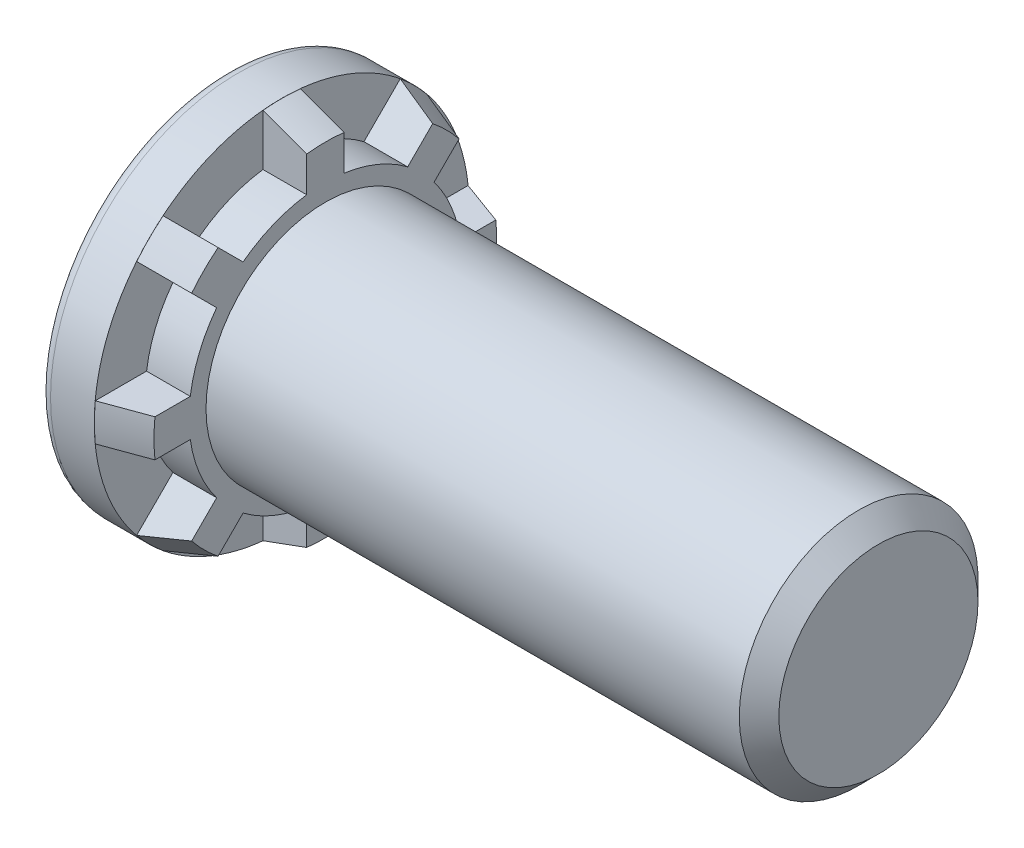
ISO-10303-21;
HEADER;
FILE_DESCRIPTION(('STEP AP214'),'2;1');
FILE_NAME('part.step','',(''),(''),'','','');
FILE_SCHEMA(('AUTOMOTIVE_DESIGN { 1 0 10303 214 1 1 1 1 }'));
ENDSEC;
DATA;
#1=APPLICATION_CONTEXT('core data for automotive mechanical design processes');
#2=APPLICATION_PROTOCOL_DEFINITION('international standard','automotive_design',2000,#1);
#3=PRODUCT_CONTEXT('',#1,'mechanical');
#4=PRODUCT('Part','Part','',(#3));
#5=PRODUCT_RELATED_PRODUCT_CATEGORY('part','',(#4));
#6=PRODUCT_DEFINITION_FORMATION('','',#4);
#7=PRODUCT_DEFINITION_CONTEXT('part definition',#1,'design');
#8=PRODUCT_DEFINITION('design','',#6,#7);
#9=PRODUCT_DEFINITION_SHAPE('','',#8);
#10=(LENGTH_UNIT() NAMED_UNIT(*) SI_UNIT(.MILLI.,.METRE.));
#11=(NAMED_UNIT(*) PLANE_ANGLE_UNIT() SI_UNIT($,.RADIAN.));
#12=(NAMED_UNIT(*) SI_UNIT($,.STERADIAN.) SOLID_ANGLE_UNIT());
#13=UNCERTAINTY_MEASURE_WITH_UNIT(LENGTH_MEASURE(1.E-05),#10,'distance_accuracy_value','');
#14=(GEOMETRIC_REPRESENTATION_CONTEXT(3) GLOBAL_UNCERTAINTY_ASSIGNED_CONTEXT((#13)) GLOBAL_UNIT_ASSIGNED_CONTEXT((#10,
#11,#12)) REPRESENTATION_CONTEXT('',''));
#15=CARTESIAN_POINT('',(0.,0.,0.));
#16=DIRECTION('',(0.,0.,1.));
#17=DIRECTION('',(1.,0.,0.));
#18=AXIS2_PLACEMENT_3D('',#15,#16,#17);
#19=CARTESIAN_POINT('',(0.00254,0.,0.));
#20=DIRECTION('',(-1.,0.,0.));
#21=DIRECTION('',(0.,0.,1.));
#22=AXIS2_PLACEMENT_3D('',#19,#20,#21);
#23=CONICAL_SURFACE('',#22,7.84746,0.349065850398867);
#24=CARTESIAN_POINT('',(5.22484515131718,0.782172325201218,-5.89503216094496));
#25=CARTESIAN_POINT('',(4.4025998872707,0.782172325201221,-6.19690738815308));
#26=CARTESIAN_POINT('',(3.58023889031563,0.782172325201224,-6.49846704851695));
#27=CARTESIAN_POINT('',(1.93534501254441,0.782172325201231,-7.10111683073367));
#28=CARTESIAN_POINT('',(1.11281213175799,0.782172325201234,-7.40220695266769));
#29=CARTESIAN_POINT('',(-0.532366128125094,0.782172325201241,-8.00407932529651));
#30=CARTESIAN_POINT('',(-1.35501150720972,0.782172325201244,-8.30486157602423));
#31=CARTESIAN_POINT('',(-3.00038658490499,0.78217232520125,-8.90619580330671));
#32=CARTESIAN_POINT('',(-3.82311628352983,0.782172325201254,-9.20674777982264));
#33=CARTESIAN_POINT('',(-4.64587386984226,0.782172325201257,-9.50722335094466));
#34=B_SPLINE_CURVE_WITH_KNOTS('',3,(#24,#25,#26,#27,#28,#29,#30,#31,#32,#33),.UNSPECIFIED.,.F.,
.F.,(4,2,2,2,4),(0.,2.62772566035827,5.25545086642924,7.88317579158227,10.510901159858),.UNSPECIFIED.);
#35=CARTESIAN_POINT('',(1.83199999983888,0.782172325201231,-7.1388693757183));
#36=VERTEX_POINT('',#35);
#37=CARTESIAN_POINT('',(0.00254,0.782172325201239,-7.80838234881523));
#38=VERTEX_POINT('',#37);
#39=EDGE_CURVE('E327',#36,#38,#34,.T.);
#40=ORIENTED_EDGE('',*,*,#39,.F.);
#41=CARTESIAN_POINT('',(1.832,0.,0.));
#42=DIRECTION('',(-1.,0.,0.));
#43=DIRECTION('',(0.,0.,1.));
#44=AXIS2_PLACEMENT_3D('',#41,#42,#43);
#45=CIRCLE('',#44,7.18159101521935);
#46=CARTESIAN_POINT('',(1.83199999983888,-0.782172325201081,-7.13886937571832));
#47=VERTEX_POINT('',#46);
#48=EDGE_CURVE('E562',#36,#47,#45,.T.);
#49=ORIENTED_EDGE('',*,*,#48,.T.);
#50=CARTESIAN_POINT('',(-4.64587386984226,-0.782172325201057,-9.50722335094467));
#51=CARTESIAN_POINT('',(-3.82311628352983,-0.78217232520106,-9.20674777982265));
#52=CARTESIAN_POINT('',(-3.00038658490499,-0.782172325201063,-8.90619580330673));
#53=CARTESIAN_POINT('',(-1.35501150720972,-0.782172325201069,-8.30486157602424));
#54=CARTESIAN_POINT('',(-0.532366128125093,-0.782172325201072,-8.00407932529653));
#55=CARTESIAN_POINT('',(1.11281213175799,-0.782172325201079,-7.4022069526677));
#56=CARTESIAN_POINT('',(1.93534501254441,-0.782172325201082,-7.10111683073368));
#57=CARTESIAN_POINT('',(3.58023889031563,-0.782172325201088,-6.49846704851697));
#58=CARTESIAN_POINT('',(4.4025998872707,-0.782172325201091,-6.1969073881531));
#59=CARTESIAN_POINT('',(5.22484515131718,-0.782172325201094,-5.89503216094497));
#60=B_SPLINE_CURVE_WITH_KNOTS('',3,(#50,#51,#52,#53,#54,#55,#56,#57,#58,#59),.UNSPECIFIED.,.F.,
.F.,(4,2,2,2,4),(0.,2.62772536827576,5.25545029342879,7.88317549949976,10.510901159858),.UNSPECIFIED.);
#61=CARTESIAN_POINT('',(0.00254,-0.782172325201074,-7.80838234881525));
#62=VERTEX_POINT('',#61);
#63=EDGE_CURVE('E353',#62,#47,#60,.T.);
#64=ORIENTED_EDGE('',*,*,#63,.F.);
#65=CARTESIAN_POINT('',(0.00254,0.,0.));
#66=DIRECTION('',(-1.,0.,0.));
#67=DIRECTION('',(0.,0.,1.));
#68=AXIS2_PLACEMENT_3D('',#65,#66,#67);
#69=CIRCLE('',#68,7.84746);
#70=EDGE_CURVE('E536',#38,#62,#69,.T.);
#71=ORIENTED_EDGE('',*,*,#70,.F.);
#72=EDGE_LOOP('',(#40,#49,#64,#71));
#73=FACE_BOUND('',#72,.T.);
#74=ADVANCED_FACE('F33',(#73),#23,.T.);
#75=CARTESIAN_POINT('',(0.,0.,0.));
#76=DIRECTION('',(-1.,0.,0.));
#77=DIRECTION('',(0.,0.,1.));
#78=AXIS2_PLACEMENT_3D('',#75,#76,#77);
#79=CYLINDRICAL_SURFACE('',#78,7.84746);
#80=CARTESIAN_POINT('',(0.,0.,0.));
#81=DIRECTION('',(-1.,0.,0.));
#82=DIRECTION('',(0.,0.,1.));
#83=AXIS2_PLACEMENT_3D('',#80,#81,#82);
#84=CIRCLE('',#83,7.84746);
#85=CARTESIAN_POINT('',(0.,0.782172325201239,-7.80838234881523));
#86=VERTEX_POINT('',#85);
#87=CARTESIAN_POINT('',(-1.61121766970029E-10,-0.782172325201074,-7.80838234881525));
#88=VERTEX_POINT('',#87);
#89=EDGE_CURVE('E539',#86,#88,#84,.T.);
#90=ORIENTED_EDGE('',*,*,#89,.F.);
#91=DIRECTION('',(-1.,0.,0.));
#92=VECTOR('',#91,1.);
#93=CARTESIAN_POINT('',(0.,0.782172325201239,-7.80838234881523));
#94=LINE('',#93,#92);
#95=EDGE_CURVE('E11',#86,#38,#94,.F.);
#96=ORIENTED_EDGE('',*,*,#95,.T.);
#97=ORIENTED_EDGE('',*,*,#70,.T.);
#98=DIRECTION('',(-1.,0.,0.));
#99=VECTOR('',#98,1.);
#100=CARTESIAN_POINT('',(0.,-0.782172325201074,-7.80838234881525));
#101=LINE('',#100,#99);
#102=EDGE_CURVE('E598',#62,#88,#101,.T.);
#103=ORIENTED_EDGE('',*,*,#102,.T.);
#104=EDGE_LOOP('',(#90,#96,#97,#103));
#105=FACE_BOUND('',#104,.T.);
#106=ADVANCED_FACE('F709',(#105),#79,.T.);
#107=CARTESIAN_POINT('',(1.83219999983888,-4.49481180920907,-5.60097051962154));
#108=CARTESIAN_POINT('',(1.52724085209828,-4.57376577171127,-5.67992448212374));
#109=CARTESIAN_POINT('',(1.22227294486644,-4.65270280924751,-5.75886151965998));
#110=CARTESIAN_POINT('',(0.612319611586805,-4.81054303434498,-5.91670174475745));
#111=CARTESIAN_POINT('',(0.307334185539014,-4.88944622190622,-5.9956049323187));
#112=CARTESIAN_POINT('',(0.00233999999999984,-4.96833248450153,-6.074491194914));
#113=B_SPLINE_CURVE_WITH_KNOTS('',3,(#107,#108,#109,#110,#111,#112),.UNSPECIFIED.,.F.,.F.,(4,2,
4),(0.,0.974272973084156,1.94854594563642),.UNSPECIFIED.);
#114=CARTESIAN_POINT('',(1.83199999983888,-4.49486359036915,-5.60102230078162));
#115=VERTEX_POINT('',#114);
#116=CARTESIAN_POINT('',(0.00254,-4.96828075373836,-6.07443946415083));
#117=VERTEX_POINT('',#116);
#118=EDGE_CURVE('E346',#115,#117,#113,.T.);
#119=ORIENTED_EDGE('',*,*,#118,.F.);
#120=CARTESIAN_POINT('',(1.83199999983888,-5.60102230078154,-4.49486359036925));
#121=VERTEX_POINT('',#120);
#122=EDGE_CURVE('E712',#115,#121,#45,.T.);
#123=ORIENTED_EDGE('',*,*,#122,.T.);
#124=CARTESIAN_POINT('',(0.00234000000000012,-6.07449119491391,-4.96833248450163));
#125=CARTESIAN_POINT('',(0.307334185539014,-5.99560493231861,-4.88944622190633));
#126=CARTESIAN_POINT('',(0.612319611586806,-5.91670174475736,-4.81054303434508));
#127=CARTESIAN_POINT('',(1.22227294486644,-5.7588615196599,-4.65270280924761));
#128=CARTESIAN_POINT('',(1.52724085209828,-5.67992448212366,-4.57376577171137));
#129=CARTESIAN_POINT('',(1.83219999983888,-5.60097051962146,-4.49481180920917));
#130=B_SPLINE_CURVE_WITH_KNOTS('',3,(#124,#125,#126,#127,#128,#129),.UNSPECIFIED.,.F.,.F.,(4,2,
4),(0.,0.974272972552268,1.94854594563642),.UNSPECIFIED.);
#131=CARTESIAN_POINT('',(0.00254,-6.07443946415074,-4.96828075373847));
#132=VERTEX_POINT('',#131);
#133=EDGE_CURVE('E374',#132,#121,#130,.T.);
#134=ORIENTED_EDGE('',*,*,#133,.F.);
#135=EDGE_CURVE('E704',#117,#132,#69,.T.);
#136=ORIENTED_EDGE('',*,*,#135,.F.);
#137=EDGE_LOOP('',(#119,#123,#134,#136));
#138=FACE_BOUND('',#137,.T.);
#139=ADVANCED_FACE('F762',(#138),#23,.T.);
#140=CARTESIAN_POINT('',(0.,-4.96828075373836,-6.07443946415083));
#141=VERTEX_POINT('',#140);
#142=CARTESIAN_POINT('',(-1.61121766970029E-10,-6.07443946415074,-4.96828075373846));
#143=VERTEX_POINT('',#142);
#144=EDGE_CURVE('E654',#141,#143,#84,.T.);
#145=ORIENTED_EDGE('',*,*,#144,.F.);
#146=DIRECTION('',(-1.,0.,0.));
#147=VECTOR('',#146,1.);
#148=CARTESIAN_POINT('',(0.,-4.96828075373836,-6.07443946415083));
#149=LINE('',#148,#147);
#150=EDGE_CURVE('E601',#141,#117,#149,.F.);
#151=ORIENTED_EDGE('',*,*,#150,.T.);
#152=ORIENTED_EDGE('',*,*,#135,.T.);
#153=DIRECTION('',(-1.,0.,0.));
#154=VECTOR('',#153,1.);
#155=CARTESIAN_POINT('',(0.,-6.07443946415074,-4.96828075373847));
#156=LINE('',#155,#154);
#157=EDGE_CURVE('E592',#132,#143,#156,.T.);
#158=ORIENTED_EDGE('',*,*,#157,.T.);
#159=EDGE_LOOP('',(#145,#151,#152,#158));
#160=FACE_BOUND('',#159,.T.);
#161=ADVANCED_FACE('F655',(#160),#79,.T.);
#162=CARTESIAN_POINT('',(5.22484515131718,-5.89503216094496,-0.782172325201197));
#163=CARTESIAN_POINT('',(4.4025998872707,-6.19690738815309,-0.782172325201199));
#164=CARTESIAN_POINT('',(3.58023889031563,-6.49846704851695,-0.782172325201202));
#165=CARTESIAN_POINT('',(1.93534501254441,-7.10111683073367,-0.782172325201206));
#166=CARTESIAN_POINT('',(1.11281213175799,-7.40220695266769,-0.782172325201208));
#167=CARTESIAN_POINT('',(-0.532366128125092,-8.00407932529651,-0.782172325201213));
#168=CARTESIAN_POINT('',(-1.35501150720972,-8.30486157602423,-0.782172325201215));
#169=CARTESIAN_POINT('',(-3.00038658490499,-8.90619580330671,-0.78217232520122));
#170=CARTESIAN_POINT('',(-3.82311628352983,-9.20674777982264,-0.782172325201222));
#171=CARTESIAN_POINT('',(-4.64587386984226,-9.50722335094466,-0.782172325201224));
#172=B_SPLINE_CURVE_WITH_KNOTS('',3,(#162,#163,#164,#165,#166,#167,#168,#169,#170,#171),
.UNSPECIFIED.,.F.,.F.,(4,2,2,2,4),(0.,2.62772566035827,5.25545086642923,7.88317579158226,
10.510901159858),.UNSPECIFIED.);
#173=CARTESIAN_POINT('',(1.83199999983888,-7.1388693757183,-0.782172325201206));
#174=VERTEX_POINT('',#173);
#175=CARTESIAN_POINT('',(0.00254,-7.80838234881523,-0.782172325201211));
#176=VERTEX_POINT('',#175);
#177=EDGE_CURVE('E383',#174,#176,#172,.T.);
#178=ORIENTED_EDGE('',*,*,#177,.F.);
#179=CARTESIAN_POINT('',(1.83199999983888,-7.13886937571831,0.782172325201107));
#180=VERTEX_POINT('',#179);
#181=EDGE_CURVE('E716',#174,#180,#45,.T.);
#182=ORIENTED_EDGE('',*,*,#181,.T.);
#183=CARTESIAN_POINT('',(-4.64587386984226,-9.50722335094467,0.78217232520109));
#184=CARTESIAN_POINT('',(-3.82311628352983,-9.20674777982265,0.782172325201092));
#185=CARTESIAN_POINT('',(-3.00038658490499,-8.90619580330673,0.782172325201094));
#186=CARTESIAN_POINT('',(-1.35501150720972,-8.30486157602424,0.782172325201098));
#187=CARTESIAN_POINT('',(-0.532366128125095,-8.00407932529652,0.7821723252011));
#188=CARTESIAN_POINT('',(1.11281213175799,-7.4022069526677,0.782172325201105));
#189=CARTESIAN_POINT('',(1.93534501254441,-7.10111683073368,0.782172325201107));
#190=CARTESIAN_POINT('',(3.58023889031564,-6.49846704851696,0.782172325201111));
#191=CARTESIAN_POINT('',(4.4025998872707,-6.1969073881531,0.782172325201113));
#192=CARTESIAN_POINT('',(5.22484515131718,-5.89503216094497,0.782172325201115));
#193=B_SPLINE_CURVE_WITH_KNOTS('',3,(#183,#184,#185,#186,#187,#188,#189,#190,#191,#192),
.UNSPECIFIED.,.F.,.F.,(4,2,2,2,4),(0.,2.62772536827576,5.25545029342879,7.88317549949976,
10.510901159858),.UNSPECIFIED.);
#194=CARTESIAN_POINT('',(0.00254,-7.80838234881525,0.782172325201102));
#195=VERTEX_POINT('',#194);
#196=EDGE_CURVE('E411',#195,#180,#193,.T.);
#197=ORIENTED_EDGE('',*,*,#196,.F.);
#198=EDGE_CURVE('E700',#176,#195,#69,.T.);
#199=ORIENTED_EDGE('',*,*,#198,.F.);
#200=EDGE_LOOP('',(#178,#182,#197,#199));
#201=FACE_BOUND('',#200,.T.);
#202=ADVANCED_FACE('F768',(#201),#23,.T.);
#203=CARTESIAN_POINT('',(0.,-7.80838234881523,-0.782172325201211));
#204=VERTEX_POINT('',#203);
#205=CARTESIAN_POINT('',(-1.61121766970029E-10,-7.80838234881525,0.782172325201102));
#206=VERTEX_POINT('',#205);
#207=EDGE_CURVE('E658',#204,#206,#84,.T.);
#208=ORIENTED_EDGE('',*,*,#207,.F.);
#209=DIRECTION('',(-1.,0.,0.));
#210=VECTOR('',#209,1.);
#211=CARTESIAN_POINT('',(0.,-7.80838234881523,-0.782172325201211));
#212=LINE('',#211,#210);
#213=EDGE_CURVE('E595',#204,#176,#212,.F.);
#214=ORIENTED_EDGE('',*,*,#213,.T.);
#215=ORIENTED_EDGE('',*,*,#198,.T.);
#216=DIRECTION('',(-1.,0.,0.));
#217=VECTOR('',#216,1.);
#218=CARTESIAN_POINT('',(0.,-7.80838234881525,0.782172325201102));
#219=LINE('',#218,#217);
#220=EDGE_CURVE('E586',#195,#206,#219,.T.);
#221=ORIENTED_EDGE('',*,*,#220,.T.);
#222=EDGE_LOOP('',(#208,#214,#215,#221));
#223=FACE_BOUND('',#222,.T.);
#224=ADVANCED_FACE('F793',(#223),#79,.T.);
#225=CARTESIAN_POINT('',(1.83219999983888,-5.60097051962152,4.49481180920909));
#226=CARTESIAN_POINT('',(1.52724085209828,-5.67992448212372,4.57376577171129));
#227=CARTESIAN_POINT('',(1.22227294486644,-5.75886151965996,4.65270280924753));
#228=CARTESIAN_POINT('',(0.612319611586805,-5.91670174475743,4.810543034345));
#229=CARTESIAN_POINT('',(0.307334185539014,-5.99560493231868,4.88944622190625));
#230=CARTESIAN_POINT('',(0.00234,-6.07449119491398,4.96833248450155));
#231=B_SPLINE_CURVE_WITH_KNOTS('',3,(#225,#226,#227,#228,#229,#230),.UNSPECIFIED.,.F.,.F.,(4,2,
4),(0.,0.974272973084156,1.94854594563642),.UNSPECIFIED.);
#232=CARTESIAN_POINT('',(1.83199999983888,-5.6010223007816,4.49486359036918));
#233=VERTEX_POINT('',#232);
#234=CARTESIAN_POINT('',(0.00254,-6.07443946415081,4.96828075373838));
#235=VERTEX_POINT('',#234);
#236=EDGE_CURVE('E404',#233,#235,#231,.T.);
#237=ORIENTED_EDGE('',*,*,#236,.F.);
#238=CARTESIAN_POINT('',(1.83199999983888,-4.49486359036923,5.60102230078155));
#239=VERTEX_POINT('',#238);
#240=EDGE_CURVE('E717',#233,#239,#45,.T.);
#241=ORIENTED_EDGE('',*,*,#240,.T.);
#242=CARTESIAN_POINT('',(0.00233999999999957,-4.96833248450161,6.07449119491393));
#243=CARTESIAN_POINT('',(0.307334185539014,-4.88944622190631,5.99560493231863));
#244=CARTESIAN_POINT('',(0.612319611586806,-4.81054303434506,5.91670174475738));
#245=CARTESIAN_POINT('',(1.22227294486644,-4.65270280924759,5.75886151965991));
#246=CARTESIAN_POINT('',(1.52724085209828,-4.57376577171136,5.67992448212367));
#247=CARTESIAN_POINT('',(1.83219999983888,-4.49481180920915,5.60097051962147));
#248=B_SPLINE_CURVE_WITH_KNOTS('',3,(#242,#243,#244,#245,#246,#247),.UNSPECIFIED.,.F.,.F.,(4,2,
4),(0.,0.974272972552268,1.94854594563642),.UNSPECIFIED.);
#249=CARTESIAN_POINT('',(0.00254,-4.96828075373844,6.07443946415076));
#250=VERTEX_POINT('',#249);
#251=EDGE_CURVE('E432',#250,#239,#248,.T.);
#252=ORIENTED_EDGE('',*,*,#251,.F.);
#253=EDGE_CURVE('E696',#235,#250,#69,.T.);
#254=ORIENTED_EDGE('',*,*,#253,.F.);
#255=EDGE_LOOP('',(#237,#241,#252,#254));
#256=FACE_BOUND('',#255,.T.);
#257=ADVANCED_FACE('F789',(#256),#23,.T.);
#258=CARTESIAN_POINT('',(0.,-6.07443946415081,4.96828075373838));
#259=VERTEX_POINT('',#258);
#260=CARTESIAN_POINT('',(-1.61121766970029E-10,-4.96828075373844,6.07443946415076));
#261=VERTEX_POINT('',#260);
#262=EDGE_CURVE('E659',#259,#261,#84,.T.);
#263=ORIENTED_EDGE('',*,*,#262,.F.);
#264=DIRECTION('',(-1.,0.,0.));
#265=VECTOR('',#264,1.);
#266=CARTESIAN_POINT('',(0.,-6.07443946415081,4.96828075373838));
#267=LINE('',#266,#265);
#268=EDGE_CURVE('E589',#259,#235,#267,.F.);
#269=ORIENTED_EDGE('',*,*,#268,.T.);
#270=ORIENTED_EDGE('',*,*,#253,.T.);
#271=DIRECTION('',(-1.,0.,0.));
#272=VECTOR('',#271,1.);
#273=CARTESIAN_POINT('',(0.,-4.96828075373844,6.07443946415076));
#274=LINE('',#273,#272);
#275=EDGE_CURVE('E580',#250,#261,#274,.T.);
#276=ORIENTED_EDGE('',*,*,#275,.T.);
#277=EDGE_LOOP('',(#263,#269,#270,#276));
#278=FACE_BOUND('',#277,.T.);
#279=ADVANCED_FACE('F787',(#278),#79,.T.);
#280=CARTESIAN_POINT('',(5.22484515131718,-0.782172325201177,5.89503216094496));
#281=CARTESIAN_POINT('',(4.4025998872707,-0.782172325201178,6.19690738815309));
#282=CARTESIAN_POINT('',(3.58023889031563,-0.78217232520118,6.49846704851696));
#283=CARTESIAN_POINT('',(1.93534501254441,-0.782172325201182,7.10111683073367));
#284=CARTESIAN_POINT('',(1.11281213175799,-0.782172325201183,7.40220695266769));
#285=CARTESIAN_POINT('',(-0.532366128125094,-0.782172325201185,8.00407932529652));
#286=CARTESIAN_POINT('',(-1.35501150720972,-0.782172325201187,8.30486157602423));
#287=CARTESIAN_POINT('',(-3.00038658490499,-0.782172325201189,8.90619580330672));
#288=CARTESIAN_POINT('',(-3.82311628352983,-0.78217232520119,9.20674777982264));
#289=CARTESIAN_POINT('',(-4.64587386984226,-0.782172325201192,9.50722335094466));
#290=B_SPLINE_CURVE_WITH_KNOTS('',3,(#280,#281,#282,#283,#284,#285,#286,#287,#288,#289),
.UNSPECIFIED.,.F.,.F.,(4,2,2,2,4),(0.,2.62772566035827,5.25545086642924,7.88317579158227,
10.510901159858),.UNSPECIFIED.);
#291=CARTESIAN_POINT('',(1.83199999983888,-0.782172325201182,7.13886937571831));
#292=VERTEX_POINT('',#291);
#293=CARTESIAN_POINT('',(0.00254,-0.782172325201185,7.80838234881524));
#294=VERTEX_POINT('',#293);
#295=EDGE_CURVE('E441',#292,#294,#290,.T.);
#296=ORIENTED_EDGE('',*,*,#295,.F.);
#297=CARTESIAN_POINT('',(1.83199999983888,0.782172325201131,7.13886937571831));
#298=VERTEX_POINT('',#297);
#299=EDGE_CURVE('E723',#292,#298,#45,.T.);
#300=ORIENTED_EDGE('',*,*,#299,.T.);
#301=CARTESIAN_POINT('',(-4.64587386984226,0.782172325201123,9.50722335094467));
#302=CARTESIAN_POINT('',(-3.82311628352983,0.782172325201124,9.20674777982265));
#303=CARTESIAN_POINT('',(-3.00038658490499,0.782172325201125,8.90619580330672));
#304=CARTESIAN_POINT('',(-1.35501150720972,0.782172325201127,8.30486157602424));
#305=CARTESIAN_POINT('',(-0.532366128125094,0.782172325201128,8.00407932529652));
#306=CARTESIAN_POINT('',(1.11281213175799,0.78217232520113,7.4022069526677));
#307=CARTESIAN_POINT('',(1.93534501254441,0.782172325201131,7.10111683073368));
#308=CARTESIAN_POINT('',(3.58023889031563,0.782172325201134,6.49846704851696));
#309=CARTESIAN_POINT('',(4.4025998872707,0.782172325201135,6.19690738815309));
#310=CARTESIAN_POINT('',(5.22484515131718,0.782172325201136,5.89503216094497));
#311=B_SPLINE_CURVE_WITH_KNOTS('',3,(#301,#302,#303,#304,#305,#306,#307,#308,#309,#310),
.UNSPECIFIED.,.F.,.F.,(4,2,2,2,4),(0.,2.62772536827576,5.25545029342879,7.88317549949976,
10.510901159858),.UNSPECIFIED.);
#312=CARTESIAN_POINT('',(0.00254,0.782172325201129,7.80838234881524));
#313=VERTEX_POINT('',#312);
#314=EDGE_CURVE('E469',#313,#298,#311,.T.);
#315=ORIENTED_EDGE('',*,*,#314,.F.);
#316=EDGE_CURVE('E692',#294,#313,#69,.T.);
#317=ORIENTED_EDGE('',*,*,#316,.F.);
#318=EDGE_LOOP('',(#296,#300,#315,#317));
#319=FACE_BOUND('',#318,.T.);
#320=ADVANCED_FACE('F783',(#319),#23,.T.);
#321=CARTESIAN_POINT('',(0.,-0.782172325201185,7.80838234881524));
#322=VERTEX_POINT('',#321);
#323=CARTESIAN_POINT('',(-1.61121766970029E-10,0.782172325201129,7.80838234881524));
#324=VERTEX_POINT('',#323);
#325=EDGE_CURVE('E662',#322,#324,#84,.T.);
#326=ORIENTED_EDGE('',*,*,#325,.F.);
#327=DIRECTION('',(-1.,0.,0.));
#328=VECTOR('',#327,1.);
#329=CARTESIAN_POINT('',(0.,-0.782172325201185,7.80838234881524));
#330=LINE('',#329,#328);
#331=EDGE_CURVE('E583',#322,#294,#330,.F.);
#332=ORIENTED_EDGE('',*,*,#331,.T.);
#333=ORIENTED_EDGE('',*,*,#316,.T.);
#334=DIRECTION('',(-1.,0.,0.));
#335=VECTOR('',#334,1.);
#336=CARTESIAN_POINT('',(0.,0.782172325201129,7.80838234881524));
#337=LINE('',#336,#335);
#338=EDGE_CURVE('E574',#313,#324,#337,.T.);
#339=ORIENTED_EDGE('',*,*,#338,.T.);
#340=EDGE_LOOP('',(#326,#332,#333,#339));
#341=FACE_BOUND('',#340,.T.);
#342=ADVANCED_FACE('F781',(#341),#79,.T.);
#343=CARTESIAN_POINT('',(1.83219999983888,4.49481180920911,5.60097051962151));
#344=CARTESIAN_POINT('',(1.52724085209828,4.57376577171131,5.67992448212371));
#345=CARTESIAN_POINT('',(1.22227294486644,4.65270280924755,5.75886151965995));
#346=CARTESIAN_POINT('',(0.612319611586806,4.81054303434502,5.91670174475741));
#347=CARTESIAN_POINT('',(0.307334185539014,4.88944622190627,5.99560493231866));
#348=CARTESIAN_POINT('',(0.0023399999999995,4.96833248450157,6.07449119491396));
#349=B_SPLINE_CURVE_WITH_KNOTS('',3,(#343,#344,#345,#346,#347,#348),.UNSPECIFIED.,.F.,.F.,(4,2,
4),(0.,0.974272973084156,1.94854594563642),.UNSPECIFIED.);
#350=CARTESIAN_POINT('',(1.83199999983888,4.49486359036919,5.60102230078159));
#351=VERTEX_POINT('',#350);
#352=CARTESIAN_POINT('',(0.00254,4.9682807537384,6.07443946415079));
#353=VERTEX_POINT('',#352);
#354=EDGE_CURVE('E462',#351,#353,#349,.T.);
#355=ORIENTED_EDGE('',*,*,#354,.F.);
#356=CARTESIAN_POINT('',(1.83199999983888,5.60102230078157,4.49486359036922));
#357=VERTEX_POINT('',#356);
#358=EDGE_CURVE('E728',#351,#357,#45,.T.);
#359=ORIENTED_EDGE('',*,*,#358,.T.);
#360=CARTESIAN_POINT('',(0.00234000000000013,6.07449119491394,4.96833248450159));
#361=CARTESIAN_POINT('',(0.307334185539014,5.99560493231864,4.88944622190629));
#362=CARTESIAN_POINT('',(0.612319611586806,5.9167017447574,4.81054303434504));
#363=CARTESIAN_POINT('',(1.22227294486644,5.75886151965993,4.65270280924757));
#364=CARTESIAN_POINT('',(1.52724085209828,5.67992448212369,4.57376577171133));
#365=CARTESIAN_POINT('',(1.83219999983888,5.60097051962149,4.49481180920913));
#366=B_SPLINE_CURVE_WITH_KNOTS('',3,(#360,#361,#362,#363,#364,#365),.UNSPECIFIED.,.F.,.F.,(4,2,
4),(0.,0.974272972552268,1.94854594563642),.UNSPECIFIED.);
#367=CARTESIAN_POINT('',(0.00254,6.07443946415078,4.96828075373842));
#368=VERTEX_POINT('',#367);
#369=EDGE_CURVE('E490',#368,#357,#366,.T.);
#370=ORIENTED_EDGE('',*,*,#369,.F.);
#371=EDGE_CURVE('E691',#353,#368,#69,.T.);
#372=ORIENTED_EDGE('',*,*,#371,.F.);
#373=EDGE_LOOP('',(#355,#359,#370,#372));
#374=FACE_BOUND('',#373,.T.);
#375=ADVANCED_FACE('F777',(#374),#23,.T.);
#376=CARTESIAN_POINT('',(0.,4.9682807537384,6.07443946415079));
#377=VERTEX_POINT('',#376);
#378=CARTESIAN_POINT('',(-1.61121766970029E-10,6.07443946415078,4.96828075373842));
#379=VERTEX_POINT('',#378);
#380=EDGE_CURVE('E665',#377,#379,#84,.T.);
#381=ORIENTED_EDGE('',*,*,#380,.F.);
#382=DIRECTION('',(-1.,0.,0.));
#383=VECTOR('',#382,1.);
#384=CARTESIAN_POINT('',(0.,4.9682807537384,6.07443946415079));
#385=LINE('',#384,#383);
#386=EDGE_CURVE('E577',#377,#353,#385,.F.);
#387=ORIENTED_EDGE('',*,*,#386,.T.);
#388=ORIENTED_EDGE('',*,*,#371,.T.);
#389=DIRECTION('',(-1.,0.,0.));
#390=VECTOR('',#389,1.);
#391=CARTESIAN_POINT('',(0.,6.07443946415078,4.96828075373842));
#392=LINE('',#391,#390);
#393=EDGE_CURVE('E568',#368,#379,#392,.T.);
#394=ORIENTED_EDGE('',*,*,#393,.T.);
#395=EDGE_LOOP('',(#381,#387,#388,#394));
#396=FACE_BOUND('',#395,.T.);
#397=ADVANCED_FACE('F775',(#396),#79,.T.);
#398=CARTESIAN_POINT('',(5.22484515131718,5.89503216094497,0.782172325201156));
#399=CARTESIAN_POINT('',(4.4025998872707,6.19690738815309,0.782172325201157));
#400=CARTESIAN_POINT('',(3.58023889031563,6.49846704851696,0.782172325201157));
#401=CARTESIAN_POINT('',(1.93534501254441,7.10111683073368,0.782172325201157));
#402=CARTESIAN_POINT('',(1.11281213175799,7.40220695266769,0.782172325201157));
#403=CARTESIAN_POINT('',(-0.532366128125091,8.00407932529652,0.782172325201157));
#404=CARTESIAN_POINT('',(-1.35501150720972,8.30486157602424,0.782172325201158));
#405=CARTESIAN_POINT('',(-3.00038658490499,8.90619580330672,0.782172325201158));
#406=CARTESIAN_POINT('',(-3.82311628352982,9.20674777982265,0.782172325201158));
#407=CARTESIAN_POINT('',(-4.64587386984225,9.50722335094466,0.782172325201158));
#408=B_SPLINE_CURVE_WITH_KNOTS('',3,(#398,#399,#400,#401,#402,#403,#404,#405,#406,#407),
.UNSPECIFIED.,.F.,.F.,(4,2,2,2,4),(0.,2.62772566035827,5.25545086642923,7.88317579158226,
10.510901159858),.UNSPECIFIED.);
#409=CARTESIAN_POINT('',(1.83199999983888,7.13886937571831,0.782172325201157));
#410=VERTEX_POINT('',#409);
#411=CARTESIAN_POINT('',(0.00254,7.80838234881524,0.782172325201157));
#412=VERTEX_POINT('',#411);
#413=EDGE_CURVE('E499',#410,#412,#408,.T.);
#414=ORIENTED_EDGE('',*,*,#413,.F.);
#415=CARTESIAN_POINT('',(1.83199999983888,7.13886937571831,-0.782172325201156));
#416=VERTEX_POINT('',#415);
#417=EDGE_CURVE('E557',#410,#416,#45,.T.);
#418=ORIENTED_EDGE('',*,*,#417,.T.);
#419=CARTESIAN_POINT('',(-4.64587386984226,9.50722335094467,-0.782172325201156));
#420=CARTESIAN_POINT('',(-3.82311628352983,9.20674777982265,-0.782172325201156));
#421=CARTESIAN_POINT('',(-3.00038658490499,8.90619580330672,-0.782172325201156));
#422=CARTESIAN_POINT('',(-1.35501150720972,8.30486157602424,-0.782172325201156));
#423=CARTESIAN_POINT('',(-0.532366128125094,8.00407932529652,-0.782172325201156));
#424=CARTESIAN_POINT('',(1.11281213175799,7.40220695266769,-0.782172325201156));
#425=CARTESIAN_POINT('',(1.93534501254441,7.10111683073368,-0.782172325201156));
#426=CARTESIAN_POINT('',(3.58023889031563,6.49846704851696,-0.782172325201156));
#427=CARTESIAN_POINT('',(4.4025998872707,6.19690738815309,-0.782172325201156));
#428=CARTESIAN_POINT('',(5.22484515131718,5.89503216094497,-0.782172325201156));
#429=B_SPLINE_CURVE_WITH_KNOTS('',3,(#419,#420,#421,#422,#423,#424,#425,#426,#427,#428),
.UNSPECIFIED.,.F.,.F.,(4,2,2,2,4),(0.,2.62772536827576,5.25545029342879,7.88317549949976,
10.510901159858),.UNSPECIFIED.);
#430=CARTESIAN_POINT('',(0.00254,7.80838234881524,-0.782172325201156));
#431=VERTEX_POINT('',#430);
#432=EDGE_CURVE('E527',#431,#416,#429,.T.);
#433=ORIENTED_EDGE('',*,*,#432,.F.);
#434=EDGE_CURVE('E526',#412,#431,#69,.T.);
#435=ORIENTED_EDGE('',*,*,#434,.F.);
#436=EDGE_LOOP('',(#414,#418,#433,#435));
#437=FACE_BOUND('',#436,.T.);
#438=ADVANCED_FACE('F739',(#437),#23,.T.);
#439=CARTESIAN_POINT('',(0.,7.80838234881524,0.782172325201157));
#440=VERTEX_POINT('',#439);
#441=CARTESIAN_POINT('',(-1.61121766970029E-10,7.80838234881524,-0.782172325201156));
#442=VERTEX_POINT('',#441);
#443=EDGE_CURVE('E535',#440,#442,#84,.T.);
#444=ORIENTED_EDGE('',*,*,#443,.F.);
#445=DIRECTION('',(-1.,0.,0.));
#446=VECTOR('',#445,1.);
#447=CARTESIAN_POINT('',(0.,7.80838234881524,0.782172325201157));
#448=LINE('',#447,#446);
#449=EDGE_CURVE('E571',#440,#412,#448,.F.);
#450=ORIENTED_EDGE('',*,*,#449,.T.);
#451=ORIENTED_EDGE('',*,*,#434,.T.);
#452=DIRECTION('',(-1.,0.,0.));
#453=VECTOR('',#452,1.);
#454=CARTESIAN_POINT('',(0.,7.80838234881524,-0.782172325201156));
#455=LINE('',#454,#453);
#456=EDGE_CURVE('E561',#431,#442,#455,.T.);
#457=ORIENTED_EDGE('',*,*,#456,.T.);
#458=EDGE_LOOP('',(#444,#450,#451,#457));
#459=FACE_BOUND('',#458,.T.);
#460=ADVANCED_FACE('F687',(#459),#79,.T.);
#461=CARTESIAN_POINT('',(0.00233999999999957,4.96833248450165,-6.07449119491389));
#462=CARTESIAN_POINT('',(0.307334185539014,4.88944622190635,-5.99560493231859));
#463=CARTESIAN_POINT('',(0.612319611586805,4.8105430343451,-5.91670174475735));
#464=CARTESIAN_POINT('',(1.22227294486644,4.65270280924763,-5.75886151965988));
#465=CARTESIAN_POINT('',(1.52724085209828,4.57376577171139,-5.67992448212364));
#466=CARTESIAN_POINT('',(1.83219999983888,4.49481180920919,-5.60097051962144));
#467=B_SPLINE_CURVE_WITH_KNOTS('',3,(#461,#462,#463,#464,#465,#466),.UNSPECIFIED.,.F.,.F.,(4,2,
4),(0.,0.974272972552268,1.94854594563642),.UNSPECIFIED.);
#468=CARTESIAN_POINT('',(0.00254,4.96828075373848,-6.07443946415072));
#469=VERTEX_POINT('',#468);
#470=CARTESIAN_POINT('',(1.83199999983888,4.49486359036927,-5.60102230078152));
#471=VERTEX_POINT('',#470);
#472=EDGE_CURVE('E320',#469,#471,#467,.T.);
#473=ORIENTED_EDGE('',*,*,#472,.F.);
#474=CARTESIAN_POINT('',(0.00254,6.07443946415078,-4.96828075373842));
#475=VERTEX_POINT('',#474);
#476=EDGE_CURVE('E532',#475,#469,#69,.T.);
#477=ORIENTED_EDGE('',*,*,#476,.F.);
#478=CARTESIAN_POINT('',(1.83219999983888,5.60097051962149,-4.49481180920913));
#479=CARTESIAN_POINT('',(1.52724085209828,5.67992448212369,-4.57376577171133));
#480=CARTESIAN_POINT('',(1.22227294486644,5.75886151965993,-4.65270280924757));
#481=CARTESIAN_POINT('',(0.612319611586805,5.9167017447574,-4.81054303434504));
#482=CARTESIAN_POINT('',(0.307334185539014,5.99560493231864,-4.88944622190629));
#483=CARTESIAN_POINT('',(0.00234000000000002,6.07449119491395,-4.96833248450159));
#484=B_SPLINE_CURVE_WITH_KNOTS('',3,(#478,#479,#480,#481,#482,#483),.UNSPECIFIED.,.F.,.F.,(4,2,
4),(0.,0.974272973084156,1.94854594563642),.UNSPECIFIED.);
#485=CARTESIAN_POINT('',(1.83199999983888,5.60102230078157,-4.49486359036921));
#486=VERTEX_POINT('',#485);
#487=EDGE_CURVE('E520',#486,#475,#484,.T.);
#488=ORIENTED_EDGE('',*,*,#487,.F.);
#489=EDGE_CURVE('E558',#486,#471,#45,.T.);
#490=ORIENTED_EDGE('',*,*,#489,.T.);
#491=EDGE_LOOP('',(#473,#477,#488,#490));
#492=FACE_BOUND('',#491,.T.);
#493=ADVANCED_FACE('F35',(#492),#23,.T.);
#494=CARTESIAN_POINT('',(1.832,7.18159101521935,0.));
#495=DIRECTION('',(1.,0.,0.));
#496=DIRECTION('',(0.,0.,-1.));
#497=AXIS2_PLACEMENT_3D('',#494,#495,#496);
#498=PLANE('',#497);
#499=DIRECTION('',(0.,0.,-1.));
#500=VECTOR('',#499,1.);
#501=CARTESIAN_POINT('',(1.83199999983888,0.782172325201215,-5.65869796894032));
#502=LINE('',#501,#500);
#503=CARTESIAN_POINT('',(1.83199999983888,0.782172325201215,-5.65869796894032));
#504=VERTEX_POINT('',#503);
#505=EDGE_CURVE('E300',#504,#36,#502,.T.);
#506=ORIENTED_EDGE('',*,*,#505,.F.);
#507=CARTESIAN_POINT('',(1.83199999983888,0.,0.));
#508=DIRECTION('',(-1.,0.,0.));
#509=DIRECTION('',(0.,-0.707106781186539,-0.707106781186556));
#510=AXIS2_PLACEMENT_3D('',#507,#508,#509);
#511=CIRCLE('',#510,5.7125);
#512=CARTESIAN_POINT('',(1.83199999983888,3.44822435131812,-4.5543830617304));
#513=VERTEX_POINT('',#512);
#514=EDGE_CURVE('E317',#513,#504,#511,.T.);
#515=ORIENTED_EDGE('',*,*,#514,.F.);
#516=DIRECTION('',(0.,-0.707106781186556,0.707106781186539));
#517=VECTOR('',#516,1.);
#518=CARTESIAN_POINT('',(1.83199999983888,3.44822435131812,-4.5543830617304));
#519=LINE('',#518,#517);
#520=EDGE_CURVE('E306',#471,#513,#519,.T.);
#521=ORIENTED_EDGE('',*,*,#520,.F.);
#522=ORIENTED_EDGE('',*,*,#489,.F.);
#523=DIRECTION('',(0.,0.707106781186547,-0.707106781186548));
#524=VECTOR('',#523,1.);
#525=CARTESIAN_POINT('',(1.83199999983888,4.55438306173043,-3.44822435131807));
#526=LINE('',#525,#524);
#527=CARTESIAN_POINT('',(1.83199999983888,4.55438306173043,-3.44822435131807));
#528=VERTEX_POINT('',#527);
#529=EDGE_CURVE('E615',#528,#486,#526,.T.);
#530=ORIENTED_EDGE('',*,*,#529,.F.);
#531=CARTESIAN_POINT('',(1.83199999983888,0.,0.));
#532=DIRECTION('',(-1.,0.,0.));
#533=DIRECTION('',(0.,0.,-1.));
#534=AXIS2_PLACEMENT_3D('',#531,#532,#533);
#535=CIRCLE('',#534,5.7125);
#536=CARTESIAN_POINT('',(1.83199999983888,5.65869796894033,-0.782172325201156));
#537=VERTEX_POINT('',#536);
#538=EDGE_CURVE('E745',#537,#528,#535,.T.);
#539=ORIENTED_EDGE('',*,*,#538,.F.);
#540=DIRECTION('',(0.,-1.,0.));
#541=VECTOR('',#540,1.);
#542=CARTESIAN_POINT('',(1.83199999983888,5.65869796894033,-0.782172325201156));
#543=LINE('',#542,#541);
#544=EDGE_CURVE('E742',#416,#537,#543,.T.);
#545=ORIENTED_EDGE('',*,*,#544,.F.);
#546=ORIENTED_EDGE('',*,*,#417,.F.);
#547=DIRECTION('',(0.,1.,0.));
#548=VECTOR('',#547,1.);
#549=CARTESIAN_POINT('',(1.83199999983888,5.65869796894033,0.782172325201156));
#550=LINE('',#549,#548);
#551=CARTESIAN_POINT('',(1.83199999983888,5.65869796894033,0.782172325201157));
#552=VERTEX_POINT('',#551);
#553=EDGE_CURVE('E477',#552,#410,#550,.T.);
#554=ORIENTED_EDGE('',*,*,#553,.F.);
#555=CARTESIAN_POINT('',(1.83199999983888,0.,0.));
#556=DIRECTION('',(-1.,0.,0.));
#557=DIRECTION('',(0.,0.707106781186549,-0.707106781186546));
#558=AXIS2_PLACEMENT_3D('',#555,#556,#557);
#559=CIRCLE('',#558,5.7125);
#560=CARTESIAN_POINT('',(1.83199999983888,4.55438306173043,3.44822435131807));
#561=VERTEX_POINT('',#560);
#562=EDGE_CURVE('E484',#561,#552,#559,.T.);
#563=ORIENTED_EDGE('',*,*,#562,.F.);
#564=DIRECTION('',(0.,-0.707106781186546,-0.707106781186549));
#565=VECTOR('',#564,1.);
#566=CARTESIAN_POINT('',(1.83199999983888,4.55438306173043,3.44822435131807));
#567=LINE('',#566,#565);
#568=EDGE_CURVE('E468',#357,#561,#567,.T.);
#569=ORIENTED_EDGE('',*,*,#568,.F.);
#570=ORIENTED_EDGE('',*,*,#358,.F.);
#571=DIRECTION('',(0.,0.707106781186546,0.707106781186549));
#572=VECTOR('',#571,1.);
#573=CARTESIAN_POINT('',(1.83199999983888,3.44822435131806,4.55438306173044));
#574=LINE('',#573,#572);
#575=CARTESIAN_POINT('',(1.83199999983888,3.44822435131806,4.55438306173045));
#576=VERTEX_POINT('',#575);
#577=EDGE_CURVE('E855',#576,#351,#574,.T.);
#578=ORIENTED_EDGE('',*,*,#577,.F.);
#579=CARTESIAN_POINT('',(1.83199999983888,0.,0.));
#580=DIRECTION('',(-1.,0.,0.));
#581=DIRECTION('',(0.,1.,0.));
#582=AXIS2_PLACEMENT_3D('',#579,#580,#581);
#583=CIRCLE('',#582,5.7125);
#584=CARTESIAN_POINT('',(1.83199999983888,0.782172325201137,5.65869796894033));
#585=VERTEX_POINT('',#584);
#586=EDGE_CURVE('E857',#585,#576,#583,.T.);
#587=ORIENTED_EDGE('',*,*,#586,.F.);
#588=DIRECTION('',(0.,0.,-1.));
#589=VECTOR('',#588,1.);
#590=CARTESIAN_POINT('',(1.83199999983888,0.782172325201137,5.65869796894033));
#591=LINE('',#590,#589);
#592=EDGE_CURVE('E859',#298,#585,#591,.T.);
#593=ORIENTED_EDGE('',*,*,#592,.F.);
#594=ORIENTED_EDGE('',*,*,#299,.F.);
#595=DIRECTION('',(0.,0.,1.));
#596=VECTOR('',#595,1.);
#597=CARTESIAN_POINT('',(1.83199999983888,-0.782172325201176,5.65869796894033));
#598=LINE('',#597,#596);
#599=CARTESIAN_POINT('',(1.83199999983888,-0.782172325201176,5.65869796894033));
#600=VERTEX_POINT('',#599);
#601=EDGE_CURVE('E419',#600,#292,#598,.T.);
#602=ORIENTED_EDGE('',*,*,#601,.F.);
#603=CARTESIAN_POINT('',(1.83199999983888,0.,0.));
#604=DIRECTION('',(-1.,0.,0.));
#605=DIRECTION('',(0.,0.707106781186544,0.707106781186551));
#606=AXIS2_PLACEMENT_3D('',#603,#604,#605);
#607=CIRCLE('',#606,5.7125);
#608=CARTESIAN_POINT('',(1.83199999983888,-3.44822435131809,4.55438306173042));
#609=VERTEX_POINT('',#608);
#610=EDGE_CURVE('E426',#609,#600,#607,.T.);
#611=ORIENTED_EDGE('',*,*,#610,.F.);
#612=DIRECTION('',(0.,0.707106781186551,-0.707106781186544));
#613=VECTOR('',#612,1.);
#614=CARTESIAN_POINT('',(1.83199999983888,-3.44822435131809,4.55438306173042));
#615=LINE('',#614,#613);
#616=EDGE_CURVE('E410',#239,#609,#615,.T.);
#617=ORIENTED_EDGE('',*,*,#616,.F.);
#618=ORIENTED_EDGE('',*,*,#240,.F.);
#619=DIRECTION('',(0.,-0.707106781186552,0.707106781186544));
#620=VECTOR('',#619,1.);
#621=CARTESIAN_POINT('',(1.83199999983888,-4.55438306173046,3.44822435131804));
#622=LINE('',#621,#620);
#623=CARTESIAN_POINT('',(1.83199999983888,-4.55438306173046,3.44822435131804));
#624=VERTEX_POINT('',#623);
#625=EDGE_CURVE('E815',#624,#233,#622,.T.);
#626=ORIENTED_EDGE('',*,*,#625,.F.);
#627=CARTESIAN_POINT('',(1.83199999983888,0.,0.));
#628=DIRECTION('',(-1.,0.,0.));
#629=DIRECTION('',(0.,0.,1.));
#630=AXIS2_PLACEMENT_3D('',#627,#628,#629);
#631=CIRCLE('',#630,5.7125);
#632=CARTESIAN_POINT('',(1.83199999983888,-5.65869796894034,0.782172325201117));
#633=VERTEX_POINT('',#632);
#634=EDGE_CURVE('E810',#633,#624,#631,.T.);
#635=ORIENTED_EDGE('',*,*,#634,.F.);
#636=DIRECTION('',(0.,1.,0.));
#637=VECTOR('',#636,1.);
#638=CARTESIAN_POINT('',(1.83199999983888,-5.65869796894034,0.782172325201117));
#639=LINE('',#638,#637);
#640=EDGE_CURVE('E804',#180,#633,#639,.T.);
#641=ORIENTED_EDGE('',*,*,#640,.F.);
#642=ORIENTED_EDGE('',*,*,#181,.F.);
#643=DIRECTION('',(0.,-1.,0.));
#644=VECTOR('',#643,1.);
#645=CARTESIAN_POINT('',(1.83199999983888,-5.65869796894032,-0.782172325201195));
#646=LINE('',#645,#644);
#647=CARTESIAN_POINT('',(1.83199999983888,-5.65869796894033,-0.782172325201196));
#648=VERTEX_POINT('',#647);
#649=EDGE_CURVE('E361',#648,#174,#646,.T.);
#650=ORIENTED_EDGE('',*,*,#649,.F.);
#651=CARTESIAN_POINT('',(1.83199999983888,0.,0.));
#652=DIRECTION('',(-1.,0.,0.));
#653=DIRECTION('',(0.,-0.707106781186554,0.707106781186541));
#654=AXIS2_PLACEMENT_3D('',#651,#652,#653);
#655=CIRCLE('',#654,5.7125);
#656=CARTESIAN_POINT('',(1.83199999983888,-4.55438306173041,-3.4482243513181));
#657=VERTEX_POINT('',#656);
#658=EDGE_CURVE('E368',#657,#648,#655,.T.);
#659=ORIENTED_EDGE('',*,*,#658,.F.);
#660=DIRECTION('',(0.,0.707106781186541,0.707106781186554));
#661=VECTOR('',#660,1.);
#662=CARTESIAN_POINT('',(1.83199999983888,-4.55438306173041,-3.4482243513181));
#663=LINE('',#662,#661);
#664=EDGE_CURVE('E352',#121,#657,#663,.T.);
#665=ORIENTED_EDGE('',*,*,#664,.F.);
#666=ORIENTED_EDGE('',*,*,#122,.F.);
#667=DIRECTION('',(0.,-0.707106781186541,-0.707106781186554));
#668=VECTOR('',#667,1.);
#669=CARTESIAN_POINT('',(1.83199999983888,-3.44822435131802,-4.55438306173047));
#670=LINE('',#669,#668);
#671=CARTESIAN_POINT('',(1.83199999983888,-3.44822435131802,-4.55438306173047));
#672=VERTEX_POINT('',#671);
#673=EDGE_CURVE('E632',#672,#115,#670,.T.);
#674=ORIENTED_EDGE('',*,*,#673,.F.);
#675=CARTESIAN_POINT('',(1.83199999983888,0.,0.));
#676=DIRECTION('',(-1.,0.,0.));
#677=DIRECTION('',(0.,-1.,0.));
#678=AXIS2_PLACEMENT_3D('',#675,#676,#677);
#679=CIRCLE('',#678,5.7125);
#680=CARTESIAN_POINT('',(1.83199999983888,-0.782172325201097,-5.65869796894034));
#681=VERTEX_POINT('',#680);
#682=EDGE_CURVE('E626',#681,#672,#679,.T.);
#683=ORIENTED_EDGE('',*,*,#682,.F.);
#684=DIRECTION('',(0.,0.,1.));
#685=VECTOR('',#684,1.);
#686=CARTESIAN_POINT('',(1.83199999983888,-0.782172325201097,-5.65869796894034));
#687=LINE('',#686,#685);
#688=EDGE_CURVE('E625',#47,#681,#687,.T.);
#689=ORIENTED_EDGE('',*,*,#688,.F.);
#690=ORIENTED_EDGE('',*,*,#48,.F.);
#691=EDGE_LOOP('',(#506,#515,#521,#522,#530,#539,#545,#546,#554,#563,#569,#570,#578,#587,#593,
#594,#602,#611,#617,#618,#626,#635,#641,#642,#650,#659,#665,#666,#674,#683,#689,#690));
#692=FACE_BOUND('',#691,.T.);
#693=CARTESIAN_POINT('',(1.832,0.,0.));
#694=DIRECTION('',(-1.,0.,0.));
#695=DIRECTION('',(0.,0.,1.));
#696=AXIS2_PLACEMENT_3D('',#693,#694,#695);
#697=CIRCLE('',#696,5.);
#698=CARTESIAN_POINT('',(1.832,0.,5.));
#699=VERTEX_POINT('',#698);
#700=EDGE_CURVE('E554',#699,#699,#697,.T.);
#701=ORIENTED_EDGE('',*,*,#700,.T.);
#702=EDGE_LOOP('',(#701));
#703=FACE_BOUND('',#702,.T.);
#704=ADVANCED_FACE('F612',(#692,#703),#498,.T.);
#705=CARTESIAN_POINT('',(0.,0.,0.));
#706=DIRECTION('',(-1.,0.,0.));
#707=DIRECTION('',(0.,0.,1.));
#708=AXIS2_PLACEMENT_3D('',#705,#706,#707);
#709=CYLINDRICAL_SURFACE('',#708,5.);
#710=CARTESIAN_POINT('',(24.1719999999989,0.,0.));
#711=DIRECTION('',(-1.,0.,0.));
#712=DIRECTION('',(0.,0.,1.));
#713=AXIS2_PLACEMENT_3D('',#710,#711,#712);
#714=CIRCLE('',#713,5.);
#715=CARTESIAN_POINT('',(24.1719999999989,0.,5.));
#716=VERTEX_POINT('',#715);
#717=EDGE_CURVE('E551',#716,#716,#714,.T.);
#718=ORIENTED_EDGE('',*,*,#717,.T.);
#719=EDGE_LOOP('',(#718));
#720=FACE_BOUND('',#719,.T.);
#721=ORIENTED_EDGE('',*,*,#700,.F.);
#722=EDGE_LOOP('',(#721));
#723=FACE_BOUND('',#722,.T.);
#724=ADVANCED_FACE('F774',(#720,#723),#709,.T.);
#725=CARTESIAN_POINT('',(25.,0.,0.));
#726=DIRECTION('',(-1.,0.,0.));
#727=DIRECTION('',(0.,0.,1.));
#728=AXIS2_PLACEMENT_3D('',#725,#726,#727);
#729=CONICAL_SURFACE('',#728,4.172,0.785398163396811);
#730=ORIENTED_EDGE('',*,*,#717,.F.);
#731=EDGE_LOOP('',(#730));
#732=FACE_BOUND('',#731,.T.);
#733=CARTESIAN_POINT('',(25.,0.,0.));
#734=DIRECTION('',(-1.,0.,0.));
#735=DIRECTION('',(0.,0.,1.));
#736=AXIS2_PLACEMENT_3D('',#733,#734,#735);
#737=CIRCLE('',#736,4.172);
#738=CARTESIAN_POINT('',(25.,0.,4.172));
#739=VERTEX_POINT('',#738);
#740=EDGE_CURVE('E548',#739,#739,#737,.T.);
#741=ORIENTED_EDGE('',*,*,#740,.T.);
#742=EDGE_LOOP('',(#741));
#743=FACE_BOUND('',#742,.T.);
#744=ADVANCED_FACE('F1063',(#732,#743),#729,.T.);
#745=CARTESIAN_POINT('',(25.,4.172,0.));
#746=DIRECTION('',(1.,0.,0.));
#747=DIRECTION('',(0.,0.,-1.));
#748=AXIS2_PLACEMENT_3D('',#745,#746,#747);
#749=PLANE('',#748);
#750=ORIENTED_EDGE('',*,*,#740,.F.);
#751=EDGE_LOOP('',(#750));
#752=FACE_BOUND('',#751,.T.);
#753=ADVANCED_FACE('F1053',(#752),#749,.T.);
#754=CARTESIAN_POINT('',(-2.29,7.392,0.));
#755=DIRECTION('',(1.,0.,0.));
#756=DIRECTION('',(0.,0.,-1.));
#757=AXIS2_PLACEMENT_3D('',#754,#755,#756);
#758=PLANE('',#757);
#759=CARTESIAN_POINT('',(-2.29,0.,0.));
#760=DIRECTION('',(-1.,0.,0.));
#761=DIRECTION('',(0.,0.,1.));
#762=AXIS2_PLACEMENT_3D('',#759,#760,#761);
#763=CIRCLE('',#762,7.392);
#764=CARTESIAN_POINT('',(-2.29,0.,7.392));
#765=VERTEX_POINT('',#764);
#766=EDGE_CURVE('E545',#765,#765,#763,.T.);
#767=ORIENTED_EDGE('',*,*,#766,.T.);
#768=EDGE_LOOP('',(#767));
#769=FACE_BOUND('',#768,.T.);
#770=ADVANCED_FACE('F1043',(#769),#758,.F.);
#771=CARTESIAN_POINT('',(-1.832,0.,0.));
#772=DIRECTION('',(-1.,0.,0.));
#773=DIRECTION('',(0.,0.,1.));
#774=AXIS2_PLACEMENT_3D('',#771,#772,#773);
#775=TOROIDAL_SURFACE('',#774,7.392,0.457999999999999);
#776=CARTESIAN_POINT('',(-1.832,0.,0.));
#777=DIRECTION('',(-1.,0.,0.));
#778=DIRECTION('',(0.,0.,1.));
#779=AXIS2_PLACEMENT_3D('',#776,#777,#778);
#780=CIRCLE('',#779,7.85);
#781=CARTESIAN_POINT('',(-1.832,0.,7.85));
#782=VERTEX_POINT('',#781);
#783=EDGE_CURVE('E542',#782,#782,#780,.T.);
#784=ORIENTED_EDGE('',*,*,#783,.T.);
#785=EDGE_LOOP('',(#784));
#786=FACE_BOUND('',#785,.T.);
#787=ORIENTED_EDGE('',*,*,#766,.F.);
#788=EDGE_LOOP('',(#787));
#789=FACE_BOUND('',#788,.T.);
#790=ADVANCED_FACE('F932',(#786,#789),#775,.T.);
#791=CARTESIAN_POINT('',(0.,0.,0.));
#792=DIRECTION('',(-1.,0.,0.));
#793=DIRECTION('',(0.,0.,1.));
#794=AXIS2_PLACEMENT_3D('',#791,#792,#793);
#795=CYLINDRICAL_SURFACE('',#794,7.85);
#796=CARTESIAN_POINT('',(0.,0.,0.));
#797=DIRECTION('',(-1.,0.,0.));
#798=DIRECTION('',(0.,0.,1.));
#799=AXIS2_PLACEMENT_3D('',#796,#797,#798);
#800=CIRCLE('',#799,7.85);
#801=CARTESIAN_POINT('',(0.,0.,7.85));
#802=VERTEX_POINT('',#801);
#803=EDGE_CURVE('E538',#802,#802,#800,.T.);
#804=ORIENTED_EDGE('',*,*,#803,.T.);
#805=EDGE_LOOP('',(#804));
#806=FACE_BOUND('',#805,.T.);
#807=ORIENTED_EDGE('',*,*,#783,.F.);
#808=EDGE_LOOP('',(#807));
#809=FACE_BOUND('',#808,.T.);
#810=ADVANCED_FACE('F922',(#806,#809),#795,.T.);
#811=CARTESIAN_POINT('',(0.,7.84746,0.));
#812=DIRECTION('',(-1.,0.,0.));
#813=DIRECTION('',(0.,0.,1.));
#814=AXIS2_PLACEMENT_3D('',#811,#812,#813);
#815=PLANE('',#814);
#816=DIRECTION('',(0.,0.,-1.));
#817=VECTOR('',#816,1.);
#818=CARTESIAN_POINT('',(-1.61121766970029E-10,0.782172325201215,-5.65869796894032));
#819=LINE('',#818,#817);
#820=CARTESIAN_POINT('',(-1.61121766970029E-10,0.782172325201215,-5.65869796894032));
#821=VERTEX_POINT('',#820);
#822=EDGE_CURVE('E49',#821,#86,#819,.T.);
#823=ORIENTED_EDGE('',*,*,#822,.T.);
#824=ORIENTED_EDGE('',*,*,#89,.T.);
#825=DIRECTION('',(0.,0.,1.));
#826=VECTOR('',#825,1.);
#827=CARTESIAN_POINT('',(-1.61121766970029E-10,-0.782172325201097,-5.65869796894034));
#828=LINE('',#827,#826);
#829=CARTESIAN_POINT('',(-1.61121766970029E-10,-0.782172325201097,-5.65869796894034));
#830=VERTEX_POINT('',#829);
#831=EDGE_CURVE('E638',#88,#830,#828,.T.);
#832=ORIENTED_EDGE('',*,*,#831,.T.);
#833=CARTESIAN_POINT('',(-1.61121766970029E-10,0.,0.));
#834=DIRECTION('',(-1.,0.,0.));
#835=DIRECTION('',(0.,-1.,0.));
#836=AXIS2_PLACEMENT_3D('',#833,#834,#835);
#837=CIRCLE('',#836,5.7125);
#838=CARTESIAN_POINT('',(-1.61121766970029E-10,-3.44822435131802,-4.55438306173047));
#839=VERTEX_POINT('',#838);
#840=EDGE_CURVE('E644',#830,#839,#837,.T.);
#841=ORIENTED_EDGE('',*,*,#840,.T.);
#842=DIRECTION('',(0.,-0.707106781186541,-0.707106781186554));
#843=VECTOR('',#842,1.);
#844=CARTESIAN_POINT('',(-1.61121766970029E-10,-3.44822435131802,-4.55438306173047));
#845=LINE('',#844,#843);
#846=EDGE_CURVE('E56',#839,#141,#845,.T.);
#847=ORIENTED_EDGE('',*,*,#846,.T.);
#848=ORIENTED_EDGE('',*,*,#144,.T.);
#849=DIRECTION('',(0.,0.707106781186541,0.707106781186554));
#850=VECTOR('',#849,1.);
#851=CARTESIAN_POINT('',(-1.61121766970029E-10,-4.55438306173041,-3.4482243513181));
#852=LINE('',#851,#850);
#853=CARTESIAN_POINT('',(-1.61121766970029E-10,-4.55438306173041,-3.4482243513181));
#854=VERTEX_POINT('',#853);
#855=EDGE_CURVE('E358',#143,#854,#852,.T.);
#856=ORIENTED_EDGE('',*,*,#855,.T.);
#857=CARTESIAN_POINT('',(-1.61121766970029E-10,0.,0.));
#858=DIRECTION('',(-1.,0.,0.));
#859=DIRECTION('',(0.,-0.707106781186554,0.707106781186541));
#860=AXIS2_PLACEMENT_3D('',#857,#858,#859);
#861=CIRCLE('',#860,5.7125);
#862=CARTESIAN_POINT('',(-1.61121766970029E-10,-5.65869796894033,-0.782172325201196));
#863=VERTEX_POINT('',#862);
#864=EDGE_CURVE('E360',#854,#863,#861,.T.);
#865=ORIENTED_EDGE('',*,*,#864,.T.);
#866=DIRECTION('',(0.,-1.,0.));
#867=VECTOR('',#866,1.);
#868=CARTESIAN_POINT('',(-1.61121766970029E-10,-5.65869796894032,-0.782172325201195));
#869=LINE('',#868,#867);
#870=EDGE_CURVE('E364',#863,#204,#869,.T.);
#871=ORIENTED_EDGE('',*,*,#870,.T.);
#872=ORIENTED_EDGE('',*,*,#207,.T.);
#873=DIRECTION('',(0.,1.,0.));
#874=VECTOR('',#873,1.);
#875=CARTESIAN_POINT('',(-1.61121766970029E-10,-5.65869796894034,0.782172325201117));
#876=LINE('',#875,#874);
#877=CARTESIAN_POINT('',(-1.61121766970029E-10,-5.65869796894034,0.782172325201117));
#878=VERTEX_POINT('',#877);
#879=EDGE_CURVE('E822',#206,#878,#876,.T.);
#880=ORIENTED_EDGE('',*,*,#879,.T.);
#881=CARTESIAN_POINT('',(-1.61121766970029E-10,0.,0.));
#882=DIRECTION('',(-1.,0.,0.));
#883=DIRECTION('',(0.,0.,1.));
#884=AXIS2_PLACEMENT_3D('',#881,#882,#883);
#885=CIRCLE('',#884,5.7125);
#886=CARTESIAN_POINT('',(-1.61121766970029E-10,-4.55438306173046,3.44822435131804));
#887=VERTEX_POINT('',#886);
#888=EDGE_CURVE('E827',#878,#887,#885,.T.);
#889=ORIENTED_EDGE('',*,*,#888,.T.);
#890=DIRECTION('',(0.,-0.707106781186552,0.707106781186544));
#891=VECTOR('',#890,1.);
#892=CARTESIAN_POINT('',(-1.61121766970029E-10,-4.55438306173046,3.44822435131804));
#893=LINE('',#892,#891);
#894=EDGE_CURVE('E818',#887,#259,#893,.T.);
#895=ORIENTED_EDGE('',*,*,#894,.T.);
#896=ORIENTED_EDGE('',*,*,#262,.T.);
#897=DIRECTION('',(0.,0.707106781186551,-0.707106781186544));
#898=VECTOR('',#897,1.);
#899=CARTESIAN_POINT('',(-1.61121766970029E-10,-3.44822435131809,4.55438306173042));
#900=LINE('',#899,#898);
#901=CARTESIAN_POINT('',(-1.61121766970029E-10,-3.44822435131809,4.55438306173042));
#902=VERTEX_POINT('',#901);
#903=EDGE_CURVE('E416',#261,#902,#900,.T.);
#904=ORIENTED_EDGE('',*,*,#903,.T.);
#905=CARTESIAN_POINT('',(-1.61121766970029E-10,0.,0.));
#906=DIRECTION('',(-1.,0.,0.));
#907=DIRECTION('',(0.,0.707106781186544,0.707106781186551));
#908=AXIS2_PLACEMENT_3D('',#905,#906,#907);
#909=CIRCLE('',#908,5.7125);
#910=CARTESIAN_POINT('',(-1.61121766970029E-10,-0.782172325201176,5.65869796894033));
#911=VERTEX_POINT('',#910);
#912=EDGE_CURVE('E418',#902,#911,#909,.T.);
#913=ORIENTED_EDGE('',*,*,#912,.T.);
#914=DIRECTION('',(0.,0.,1.));
#915=VECTOR('',#914,1.);
#916=CARTESIAN_POINT('',(-1.61121766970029E-10,-0.782172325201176,5.65869796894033));
#917=LINE('',#916,#915);
#918=EDGE_CURVE('E422',#911,#322,#917,.T.);
#919=ORIENTED_EDGE('',*,*,#918,.T.);
#920=ORIENTED_EDGE('',*,*,#325,.T.);
#921=DIRECTION('',(0.,0.,-1.));
#922=VECTOR('',#921,1.);
#923=CARTESIAN_POINT('',(-1.61121766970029E-10,0.782172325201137,5.65869796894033));
#924=LINE('',#923,#922);
#925=CARTESIAN_POINT('',(-1.61121766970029E-10,0.782172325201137,5.65869796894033));
#926=VERTEX_POINT('',#925);
#927=EDGE_CURVE('E846',#324,#926,#924,.T.);
#928=ORIENTED_EDGE('',*,*,#927,.T.);
#929=CARTESIAN_POINT('',(-1.61121766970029E-10,0.,0.));
#930=DIRECTION('',(-1.,0.,0.));
#931=DIRECTION('',(0.,1.,0.));
#932=AXIS2_PLACEMENT_3D('',#929,#930,#931);
#933=CIRCLE('',#932,5.7125);
#934=CARTESIAN_POINT('',(-1.61121766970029E-10,3.44822435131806,4.55438306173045));
#935=VERTEX_POINT('',#934);
#936=EDGE_CURVE('E862',#926,#935,#933,.T.);
#937=ORIENTED_EDGE('',*,*,#936,.T.);
#938=DIRECTION('',(0.,0.707106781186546,0.707106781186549));
#939=VECTOR('',#938,1.);
#940=CARTESIAN_POINT('',(-1.61121766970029E-10,3.44822435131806,4.55438306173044));
#941=LINE('',#940,#939);
#942=EDGE_CURVE('E853',#935,#377,#941,.T.);
#943=ORIENTED_EDGE('',*,*,#942,.T.);
#944=ORIENTED_EDGE('',*,*,#380,.T.);
#945=DIRECTION('',(0.,-0.707106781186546,-0.707106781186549));
#946=VECTOR('',#945,1.);
#947=CARTESIAN_POINT('',(-1.61121766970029E-10,4.55438306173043,3.44822435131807));
#948=LINE('',#947,#946);
#949=CARTESIAN_POINT('',(-1.61121766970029E-10,4.55438306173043,3.44822435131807));
#950=VERTEX_POINT('',#949);
#951=EDGE_CURVE('E474',#379,#950,#948,.T.);
#952=ORIENTED_EDGE('',*,*,#951,.T.);
#953=CARTESIAN_POINT('',(-1.61121766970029E-10,0.,0.));
#954=DIRECTION('',(-1.,0.,0.));
#955=DIRECTION('',(0.,0.707106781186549,-0.707106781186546));
#956=AXIS2_PLACEMENT_3D('',#953,#954,#955);
#957=CIRCLE('',#956,5.7125);
#958=CARTESIAN_POINT('',(-1.61121766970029E-10,5.65869796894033,0.782172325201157));
#959=VERTEX_POINT('',#958);
#960=EDGE_CURVE('E476',#950,#959,#957,.T.);
#961=ORIENTED_EDGE('',*,*,#960,.T.);
#962=DIRECTION('',(0.,1.,0.));
#963=VECTOR('',#962,1.);
#964=CARTESIAN_POINT('',(-1.61121766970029E-10,5.65869796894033,0.782172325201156));
#965=LINE('',#964,#963);
#966=EDGE_CURVE('E480',#959,#440,#965,.T.);
#967=ORIENTED_EDGE('',*,*,#966,.T.);
#968=ORIENTED_EDGE('',*,*,#443,.T.);
#969=DIRECTION('',(0.,-1.,0.));
#970=VECTOR('',#969,1.);
#971=CARTESIAN_POINT('',(-1.61121766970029E-10,5.65869796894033,-0.782172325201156));
#972=LINE('',#971,#970);
#973=CARTESIAN_POINT('',(-1.61121766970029E-10,5.65869796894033,-0.782172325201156));
#974=VERTEX_POINT('',#973);
#975=EDGE_CURVE('E673',#442,#974,#972,.T.);
#976=ORIENTED_EDGE('',*,*,#975,.T.);
#977=CARTESIAN_POINT('',(-1.61121766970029E-10,0.,0.));
#978=DIRECTION('',(-1.,0.,0.));
#979=DIRECTION('',(0.,0.,-1.));
#980=AXIS2_PLACEMENT_3D('',#977,#978,#979);
#981=CIRCLE('',#980,5.7125);
#982=CARTESIAN_POINT('',(-1.61121766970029E-10,4.55438306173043,-3.44822435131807));
#983=VERTEX_POINT('',#982);
#984=EDGE_CURVE('E686',#974,#983,#981,.T.);
#985=ORIENTED_EDGE('',*,*,#984,.T.);
#986=DIRECTION('',(0.,0.707106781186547,-0.707106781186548));
#987=VECTOR('',#986,1.);
#988=CARTESIAN_POINT('',(-1.61121766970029E-10,4.55438306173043,-3.44822435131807));
#989=LINE('',#988,#987);
#990=CARTESIAN_POINT('',(0.,6.07443946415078,-4.96828075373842));
#991=VERTEX_POINT('',#990);
#992=EDGE_CURVE('E749',#983,#991,#989,.T.);
#993=ORIENTED_EDGE('',*,*,#992,.T.);
#994=CARTESIAN_POINT('',(-1.61121766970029E-10,4.96828075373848,-6.07443946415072));
#995=VERTEX_POINT('',#994);
#996=EDGE_CURVE('E297',#991,#995,#84,.T.);
#997=ORIENTED_EDGE('',*,*,#996,.T.);
#998=DIRECTION('',(0.,-0.707106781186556,0.707106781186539));
#999=VECTOR('',#998,1.);
#1000=CARTESIAN_POINT('',(-1.61121766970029E-10,3.44822435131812,-4.5543830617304));
#1001=LINE('',#1000,#999);
#1002=CARTESIAN_POINT('',(-1.61121766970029E-10,3.44822435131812,-4.5543830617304));
#1003=VERTEX_POINT('',#1002);
#1004=EDGE_CURVE('E290',#995,#1003,#1001,.T.);
#1005=ORIENTED_EDGE('',*,*,#1004,.T.);
#1006=CARTESIAN_POINT('',(-1.61121766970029E-10,0.,0.));
#1007=DIRECTION('',(-1.,0.,0.));
#1008=DIRECTION('',(0.,-0.707106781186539,-0.707106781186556));
#1009=AXIS2_PLACEMENT_3D('',#1006,#1007,#1008);
#1010=CIRCLE('',#1009,5.7125);
#1011=EDGE_CURVE('E295',#1003,#821,#1010,.T.);
#1012=ORIENTED_EDGE('',*,*,#1011,.T.);
#1013=EDGE_LOOP('',(#823,#824,#832,#841,#847,#848,#856,#865,#871,#872,#880,#889,#895,#896,#904,
#913,#919,#920,#928,#937,#943,#944,#952,#961,#967,#968,#976,#985,#993,#997,#1005,#1012));
#1014=FACE_BOUND('',#1013,.T.);
#1015=ORIENTED_EDGE('',*,*,#803,.F.);
#1016=EDGE_LOOP('',(#1015));
#1017=FACE_BOUND('',#1016,.T.);
#1018=ADVANCED_FACE('F292',(#1014,#1017),#815,.F.);
#1019=ORIENTED_EDGE('',*,*,#476,.T.);
#1020=DIRECTION('',(-1.,0.,0.));
#1021=VECTOR('',#1020,1.);
#1022=CARTESIAN_POINT('',(0.,4.96828075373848,-6.07443946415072));
#1023=LINE('',#1022,#1021);
#1024=EDGE_CURVE('E42',#469,#995,#1023,.T.);
#1025=ORIENTED_EDGE('',*,*,#1024,.T.);
#1026=ORIENTED_EDGE('',*,*,#996,.F.);
#1027=DIRECTION('',(-1.,0.,0.));
#1028=VECTOR('',#1027,1.);
#1029=CARTESIAN_POINT('',(0.,6.07443946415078,-4.96828075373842));
#1030=LINE('',#1029,#1028);
#1031=EDGE_CURVE('E565',#991,#475,#1030,.F.);
#1032=ORIENTED_EDGE('',*,*,#1031,.T.);
#1033=EDGE_LOOP('',(#1019,#1025,#1026,#1032));
#1034=FACE_BOUND('',#1033,.T.);
#1035=ADVANCED_FACE('F516',(#1034),#79,.T.);
#1036=CARTESIAN_POINT('',(-1.61121766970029E-10,4.55438306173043,-3.44822435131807));
#1037=DIRECTION('',(0.,-0.707106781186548,-0.707106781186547));
#1038=DIRECTION('',(0.,0.707106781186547,-0.707106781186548));
#1039=AXIS2_PLACEMENT_3D('',#1036,#1037,#1038);
#1040=PLANE('',#1039);
#1041=ORIENTED_EDGE('',*,*,#487,.T.);
#1042=ORIENTED_EDGE('',*,*,#1031,.F.);
#1043=ORIENTED_EDGE('',*,*,#992,.F.);
#1044=DIRECTION('',(1.,0.,0.));
#1045=VECTOR('',#1044,1.);
#1046=CARTESIAN_POINT('',(-1.61121766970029E-10,4.55438306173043,-3.44822435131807));
#1047=LINE('',#1046,#1045);
#1048=EDGE_CURVE('E743',#983,#528,#1047,.T.);
#1049=ORIENTED_EDGE('',*,*,#1048,.T.);
#1050=ORIENTED_EDGE('',*,*,#529,.T.);
#1051=EDGE_LOOP('',(#1041,#1042,#1043,#1049,#1050));
#1052=FACE_BOUND('',#1051,.T.);
#1053=ADVANCED_FACE('F511',(#1052),#1040,.F.);
#1054=CARTESIAN_POINT('',(-1.61121766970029E-10,0.,0.));
#1055=DIRECTION('',(1.,0.,0.));
#1056=DIRECTION('',(0.,0.,-1.));
#1057=AXIS2_PLACEMENT_3D('',#1054,#1055,#1056);
#1058=CYLINDRICAL_SURFACE('',#1057,5.7125);
#1059=ORIENTED_EDGE('',*,*,#538,.T.);
#1060=ORIENTED_EDGE('',*,*,#1048,.F.);
#1061=ORIENTED_EDGE('',*,*,#984,.F.);
#1062=DIRECTION('',(1.,0.,0.));
#1063=VECTOR('',#1062,1.);
#1064=CARTESIAN_POINT('',(-1.61121766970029E-10,5.65869796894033,-0.782172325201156));
#1065=LINE('',#1064,#1063);
#1066=EDGE_CURVE('E684',#974,#537,#1065,.T.);
#1067=ORIENTED_EDGE('',*,*,#1066,.T.);
#1068=EDGE_LOOP('',(#1059,#1060,#1061,#1067));
#1069=FACE_BOUND('',#1068,.T.);
#1070=ADVANCED_FACE('F515',(#1069),#1058,.T.);
#1071=CARTESIAN_POINT('',(-1.61121766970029E-10,5.65869796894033,-0.782172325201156));
#1072=DIRECTION('',(0.,0.,1.));
#1073=DIRECTION('',(1.,0.,0.));
#1074=AXIS2_PLACEMENT_3D('',#1071,#1072,#1073);
#1075=PLANE('',#1074);
#1076=ORIENTED_EDGE('',*,*,#432,.T.);
#1077=ORIENTED_EDGE('',*,*,#544,.T.);
#1078=ORIENTED_EDGE('',*,*,#1066,.F.);
#1079=ORIENTED_EDGE('',*,*,#975,.F.);
#1080=ORIENTED_EDGE('',*,*,#456,.F.);
#1081=EDGE_LOOP('',(#1076,#1077,#1078,#1079,#1080));
#1082=FACE_BOUND('',#1081,.T.);
#1083=ADVANCED_FACE('F681',(#1082),#1075,.F.);
#1084=CARTESIAN_POINT('',(-1.61121766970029E-10,5.65869796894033,0.782172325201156));
#1085=DIRECTION('',(0.,0.,-1.));
#1086=DIRECTION('',(0.,1.,0.));
#1087=AXIS2_PLACEMENT_3D('',#1084,#1085,#1086);
#1088=PLANE('',#1087);
#1089=ORIENTED_EDGE('',*,*,#413,.T.);
#1090=ORIENTED_EDGE('',*,*,#449,.F.);
#1091=ORIENTED_EDGE('',*,*,#966,.F.);
#1092=DIRECTION('',(1.,0.,0.));
#1093=VECTOR('',#1092,1.);
#1094=CARTESIAN_POINT('',(-1.61121766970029E-10,5.65869796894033,0.782172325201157));
#1095=LINE('',#1094,#1093);
#1096=EDGE_CURVE('E488',#959,#552,#1095,.T.);
#1097=ORIENTED_EDGE('',*,*,#1096,.T.);
#1098=ORIENTED_EDGE('',*,*,#553,.T.);
#1099=EDGE_LOOP('',(#1089,#1090,#1091,#1097,#1098));
#1100=FACE_BOUND('',#1099,.T.);
#1101=ADVANCED_FACE('F760',(#1100),#1088,.F.);
#1102=CARTESIAN_POINT('',(-1.61121766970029E-10,0.,0.));
#1103=DIRECTION('',(1.,0.,0.));
#1104=DIRECTION('',(0.,0.,-1.));
#1105=AXIS2_PLACEMENT_3D('',#1102,#1103,#1104);
#1106=CYLINDRICAL_SURFACE('',#1105,5.7125);
#1107=ORIENTED_EDGE('',*,*,#562,.T.);
#1108=ORIENTED_EDGE('',*,*,#1096,.F.);
#1109=ORIENTED_EDGE('',*,*,#960,.F.);
#1110=DIRECTION('',(1.,0.,0.));
#1111=VECTOR('',#1110,1.);
#1112=CARTESIAN_POINT('',(-1.61121766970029E-10,4.55438306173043,3.44822435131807));
#1113=LINE('',#1112,#1111);
#1114=EDGE_CURVE('E482',#950,#561,#1113,.T.);
#1115=ORIENTED_EDGE('',*,*,#1114,.T.);
#1116=EDGE_LOOP('',(#1107,#1108,#1109,#1115));
#1117=FACE_BOUND('',#1116,.T.);
#1118=ADVANCED_FACE('F509',(#1117),#1106,.T.);
#1119=CARTESIAN_POINT('',(-1.61121766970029E-10,4.55438306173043,3.44822435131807));
#1120=DIRECTION('',(0.,-0.707106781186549,0.707106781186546));
#1121=DIRECTION('',(0.,-0.707106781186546,-0.707106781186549));
#1122=AXIS2_PLACEMENT_3D('',#1119,#1120,#1121);
#1123=PLANE('',#1122);
#1124=ORIENTED_EDGE('',*,*,#369,.T.);
#1125=ORIENTED_EDGE('',*,*,#568,.T.);
#1126=ORIENTED_EDGE('',*,*,#1114,.F.);
#1127=ORIENTED_EDGE('',*,*,#951,.F.);
#1128=ORIENTED_EDGE('',*,*,#393,.F.);
#1129=EDGE_LOOP('',(#1124,#1125,#1126,#1127,#1128));
#1130=FACE_BOUND('',#1129,.T.);
#1131=ADVANCED_FACE('F458',(#1130),#1123,.F.);
#1132=CARTESIAN_POINT('',(-1.61121766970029E-10,3.44822435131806,4.55438306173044));
#1133=DIRECTION('',(0.,0.707106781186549,-0.707106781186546));
#1134=DIRECTION('',(0.,0.707106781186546,0.707106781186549));
#1135=AXIS2_PLACEMENT_3D('',#1132,#1133,#1134);
#1136=PLANE('',#1135);
#1137=ORIENTED_EDGE('',*,*,#354,.T.);
#1138=ORIENTED_EDGE('',*,*,#386,.F.);
#1139=ORIENTED_EDGE('',*,*,#942,.F.);
#1140=DIRECTION('',(1.,0.,0.));
#1141=VECTOR('',#1140,1.);
#1142=CARTESIAN_POINT('',(-1.61121766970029E-10,3.44822435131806,4.55438306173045));
#1143=LINE('',#1142,#1141);
#1144=EDGE_CURVE('E847',#935,#576,#1143,.T.);
#1145=ORIENTED_EDGE('',*,*,#1144,.T.);
#1146=ORIENTED_EDGE('',*,*,#577,.T.);
#1147=EDGE_LOOP('',(#1137,#1138,#1139,#1145,#1146));
#1148=FACE_BOUND('',#1147,.T.);
#1149=ADVANCED_FACE('F453',(#1148),#1136,.F.);
#1150=CARTESIAN_POINT('',(-1.61121766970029E-10,0.,0.));
#1151=DIRECTION('',(1.,0.,0.));
#1152=DIRECTION('',(0.,0.,-1.));
#1153=AXIS2_PLACEMENT_3D('',#1150,#1151,#1152);
#1154=CYLINDRICAL_SURFACE('',#1153,5.7125);
#1155=ORIENTED_EDGE('',*,*,#586,.T.);
#1156=ORIENTED_EDGE('',*,*,#1144,.F.);
#1157=ORIENTED_EDGE('',*,*,#936,.F.);
#1158=DIRECTION('',(1.,0.,0.));
#1159=VECTOR('',#1158,1.);
#1160=CARTESIAN_POINT('',(-1.61121766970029E-10,0.782172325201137,5.65869796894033));
#1161=LINE('',#1160,#1159);
#1162=EDGE_CURVE('E848',#926,#585,#1161,.T.);
#1163=ORIENTED_EDGE('',*,*,#1162,.T.);
#1164=EDGE_LOOP('',(#1155,#1156,#1157,#1163));
#1165=FACE_BOUND('',#1164,.T.);
#1166=ADVANCED_FACE('F457',(#1165),#1154,.T.);
#1167=CARTESIAN_POINT('',(-1.61121766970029E-10,0.782172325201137,5.65869796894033));
#1168=DIRECTION('',(0.,-1.,0.));
#1169=DIRECTION('',(0.,0.,-1.));
#1170=AXIS2_PLACEMENT_3D('',#1167,#1168,#1169);
#1171=PLANE('',#1170);
#1172=ORIENTED_EDGE('',*,*,#314,.T.);
#1173=ORIENTED_EDGE('',*,*,#592,.T.);
#1174=ORIENTED_EDGE('',*,*,#1162,.F.);
#1175=ORIENTED_EDGE('',*,*,#927,.F.);
#1176=ORIENTED_EDGE('',*,*,#338,.F.);
#1177=EDGE_LOOP('',(#1172,#1173,#1174,#1175,#1176));
#1178=FACE_BOUND('',#1177,.T.);
#1179=ADVANCED_FACE('F843',(#1178),#1171,.F.);
#1180=CARTESIAN_POINT('',(-1.61121766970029E-10,-0.782172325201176,5.65869796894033));
#1181=DIRECTION('',(0.,1.,0.));
#1182=DIRECTION('',(0.,0.,1.));
#1183=AXIS2_PLACEMENT_3D('',#1180,#1181,#1182);
#1184=PLANE('',#1183);
#1185=ORIENTED_EDGE('',*,*,#295,.T.);
#1186=ORIENTED_EDGE('',*,*,#331,.F.);
#1187=ORIENTED_EDGE('',*,*,#918,.F.);
#1188=DIRECTION('',(1.,0.,0.));
#1189=VECTOR('',#1188,1.);
#1190=CARTESIAN_POINT('',(-1.61121766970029E-10,-0.782172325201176,5.65869796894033));
#1191=LINE('',#1190,#1189);
#1192=EDGE_CURVE('E430',#911,#600,#1191,.T.);
#1193=ORIENTED_EDGE('',*,*,#1192,.T.);
#1194=ORIENTED_EDGE('',*,*,#601,.T.);
#1195=EDGE_LOOP('',(#1185,#1186,#1187,#1193,#1194));
#1196=FACE_BOUND('',#1195,.T.);
#1197=ADVANCED_FACE('F841',(#1196),#1184,.F.);
#1198=CARTESIAN_POINT('',(-1.61121766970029E-10,0.,0.));
#1199=DIRECTION('',(1.,0.,0.));
#1200=DIRECTION('',(0.,0.,-1.));
#1201=AXIS2_PLACEMENT_3D('',#1198,#1199,#1200);
#1202=CYLINDRICAL_SURFACE('',#1201,5.7125);
#1203=ORIENTED_EDGE('',*,*,#610,.T.);
#1204=ORIENTED_EDGE('',*,*,#1192,.F.);
#1205=ORIENTED_EDGE('',*,*,#912,.F.);
#1206=DIRECTION('',(1.,0.,0.));
#1207=VECTOR('',#1206,1.);
#1208=CARTESIAN_POINT('',(-1.61121766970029E-10,-3.44822435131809,4.55438306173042));
#1209=LINE('',#1208,#1207);
#1210=EDGE_CURVE('E424',#902,#609,#1209,.T.);
#1211=ORIENTED_EDGE('',*,*,#1210,.T.);
#1212=EDGE_LOOP('',(#1203,#1204,#1205,#1211));
#1213=FACE_BOUND('',#1212,.T.);
#1214=ADVANCED_FACE('F451',(#1213),#1202,.T.);
#1215=CARTESIAN_POINT('',(-1.61121766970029E-10,-3.44822435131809,4.55438306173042));
#1216=DIRECTION('',(0.,-0.707106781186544,-0.707106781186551));
#1217=DIRECTION('',(0.,0.707106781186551,-0.707106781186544));
#1218=AXIS2_PLACEMENT_3D('',#1215,#1216,#1217);
#1219=PLANE('',#1218);
#1220=ORIENTED_EDGE('',*,*,#251,.T.);
#1221=ORIENTED_EDGE('',*,*,#616,.T.);
#1222=ORIENTED_EDGE('',*,*,#1210,.F.);
#1223=ORIENTED_EDGE('',*,*,#903,.F.);
#1224=ORIENTED_EDGE('',*,*,#275,.F.);
#1225=EDGE_LOOP('',(#1220,#1221,#1222,#1223,#1224));
#1226=FACE_BOUND('',#1225,.T.);
#1227=ADVANCED_FACE('F400',(#1226),#1219,.F.);
#1228=CARTESIAN_POINT('',(-1.61121766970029E-10,-4.55438306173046,3.44822435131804));
#1229=DIRECTION('',(0.,0.707106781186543,0.707106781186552));
#1230=DIRECTION('',(0.,-0.707106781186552,0.707106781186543));
#1231=AXIS2_PLACEMENT_3D('',#1228,#1229,#1230);
#1232=PLANE('',#1231);
#1233=ORIENTED_EDGE('',*,*,#236,.T.);
#1234=ORIENTED_EDGE('',*,*,#268,.F.);
#1235=ORIENTED_EDGE('',*,*,#894,.F.);
#1236=DIRECTION('',(1.,0.,0.));
#1237=VECTOR('',#1236,1.);
#1238=CARTESIAN_POINT('',(-1.61121766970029E-10,-4.55438306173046,3.44822435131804));
#1239=LINE('',#1238,#1237);
#1240=EDGE_CURVE('E823',#887,#624,#1239,.T.);
#1241=ORIENTED_EDGE('',*,*,#1240,.T.);
#1242=ORIENTED_EDGE('',*,*,#625,.T.);
#1243=EDGE_LOOP('',(#1233,#1234,#1235,#1241,#1242));
#1244=FACE_BOUND('',#1243,.T.);
#1245=ADVANCED_FACE('F395',(#1244),#1232,.F.);
#1246=CARTESIAN_POINT('',(-1.61121766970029E-10,0.,0.));
#1247=DIRECTION('',(1.,0.,0.));
#1248=DIRECTION('',(0.,0.,-1.));
#1249=AXIS2_PLACEMENT_3D('',#1246,#1247,#1248);
#1250=CYLINDRICAL_SURFACE('',#1249,5.7125);
#1251=ORIENTED_EDGE('',*,*,#634,.T.);
#1252=ORIENTED_EDGE('',*,*,#1240,.F.);
#1253=ORIENTED_EDGE('',*,*,#888,.F.);
#1254=DIRECTION('',(1.,0.,0.));
#1255=VECTOR('',#1254,1.);
#1256=CARTESIAN_POINT('',(-1.61121766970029E-10,-5.65869796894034,0.782172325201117));
#1257=LINE('',#1256,#1255);
#1258=EDGE_CURVE('E824',#878,#633,#1257,.T.);
#1259=ORIENTED_EDGE('',*,*,#1258,.T.);
#1260=EDGE_LOOP('',(#1251,#1252,#1253,#1259));
#1261=FACE_BOUND('',#1260,.T.);
#1262=ADVANCED_FACE('F399',(#1261),#1250,.T.);
#1263=CARTESIAN_POINT('',(-1.61121766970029E-10,-5.65869796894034,0.782172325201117));
#1264=DIRECTION('',(0.,0.,-1.));
#1265=DIRECTION('',(0.,1.,0.));
#1266=AXIS2_PLACEMENT_3D('',#1263,#1264,#1265);
#1267=PLANE('',#1266);
#1268=ORIENTED_EDGE('',*,*,#196,.T.);
#1269=ORIENTED_EDGE('',*,*,#640,.T.);
#1270=ORIENTED_EDGE('',*,*,#1258,.F.);
#1271=ORIENTED_EDGE('',*,*,#879,.F.);
#1272=ORIENTED_EDGE('',*,*,#220,.F.);
#1273=EDGE_LOOP('',(#1268,#1269,#1270,#1271,#1272));
#1274=FACE_BOUND('',#1273,.T.);
#1275=ADVANCED_FACE('F831',(#1274),#1267,.F.);
#1276=CARTESIAN_POINT('',(-1.61121766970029E-10,-5.65869796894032,-0.782172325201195));
#1277=DIRECTION('',(0.,0.,1.));
#1278=DIRECTION('',(0.,-1.,0.));
#1279=AXIS2_PLACEMENT_3D('',#1276,#1277,#1278);
#1280=PLANE('',#1279);
#1281=ORIENTED_EDGE('',*,*,#177,.T.);
#1282=ORIENTED_EDGE('',*,*,#213,.F.);
#1283=ORIENTED_EDGE('',*,*,#870,.F.);
#1284=DIRECTION('',(1.,0.,0.));
#1285=VECTOR('',#1284,1.);
#1286=CARTESIAN_POINT('',(-1.61121766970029E-10,-5.65869796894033,-0.782172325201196));
#1287=LINE('',#1286,#1285);
#1288=EDGE_CURVE('E372',#863,#648,#1287,.T.);
#1289=ORIENTED_EDGE('',*,*,#1288,.T.);
#1290=ORIENTED_EDGE('',*,*,#649,.T.);
#1291=EDGE_LOOP('',(#1281,#1282,#1283,#1289,#1290));
#1292=FACE_BOUND('',#1291,.T.);
#1293=ADVANCED_FACE('F1158',(#1292),#1280,.F.);
#1294=CARTESIAN_POINT('',(-1.61121766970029E-10,0.,0.));
#1295=DIRECTION('',(1.,0.,0.));
#1296=DIRECTION('',(0.,0.,-1.));
#1297=AXIS2_PLACEMENT_3D('',#1294,#1295,#1296);
#1298=CYLINDRICAL_SURFACE('',#1297,5.7125);
#1299=ORIENTED_EDGE('',*,*,#658,.T.);
#1300=ORIENTED_EDGE('',*,*,#1288,.F.);
#1301=ORIENTED_EDGE('',*,*,#864,.F.);
#1302=DIRECTION('',(1.,0.,0.));
#1303=VECTOR('',#1302,1.);
#1304=CARTESIAN_POINT('',(-1.61121766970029E-10,-4.55438306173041,-3.4482243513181));
#1305=LINE('',#1304,#1303);
#1306=EDGE_CURVE('E366',#854,#657,#1305,.T.);
#1307=ORIENTED_EDGE('',*,*,#1306,.T.);
#1308=EDGE_LOOP('',(#1299,#1300,#1301,#1307));
#1309=FACE_BOUND('',#1308,.T.);
#1310=ADVANCED_FACE('F393',(#1309),#1298,.T.);
#1311=CARTESIAN_POINT('',(-1.61121766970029E-10,-4.55438306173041,-3.4482243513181));
#1312=DIRECTION('',(0.,0.707106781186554,-0.707106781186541));
#1313=DIRECTION('',(0.,0.707106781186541,0.707106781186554));
#1314=AXIS2_PLACEMENT_3D('',#1311,#1312,#1313);
#1315=PLANE('',#1314);
#1316=ORIENTED_EDGE('',*,*,#133,.T.);
#1317=ORIENTED_EDGE('',*,*,#664,.T.);
#1318=ORIENTED_EDGE('',*,*,#1306,.F.);
#1319=ORIENTED_EDGE('',*,*,#855,.F.);
#1320=ORIENTED_EDGE('',*,*,#157,.F.);
#1321=EDGE_LOOP('',(#1316,#1317,#1318,#1319,#1320));
#1322=FACE_BOUND('',#1321,.T.);
#1323=ADVANCED_FACE('F342',(#1322),#1315,.F.);
#1324=CARTESIAN_POINT('',(-1.61121766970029E-10,-3.44822435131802,-4.55438306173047));
#1325=DIRECTION('',(0.,-0.707106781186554,0.707106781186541));
#1326=DIRECTION('',(0.,-0.707106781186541,-0.707106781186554));
#1327=AXIS2_PLACEMENT_3D('',#1324,#1325,#1326);
#1328=PLANE('',#1327);
#1329=ORIENTED_EDGE('',*,*,#118,.T.);
#1330=ORIENTED_EDGE('',*,*,#150,.F.);
#1331=ORIENTED_EDGE('',*,*,#846,.F.);
#1332=DIRECTION('',(1.,0.,0.));
#1333=VECTOR('',#1332,1.);
#1334=CARTESIAN_POINT('',(-1.61121766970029E-10,-3.44822435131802,-4.55438306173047));
#1335=LINE('',#1334,#1333);
#1336=EDGE_CURVE('E639',#839,#672,#1335,.T.);
#1337=ORIENTED_EDGE('',*,*,#1336,.T.);
#1338=ORIENTED_EDGE('',*,*,#673,.T.);
#1339=EDGE_LOOP('',(#1329,#1330,#1331,#1337,#1338));
#1340=FACE_BOUND('',#1339,.T.);
#1341=ADVANCED_FACE('F337',(#1340),#1328,.F.);
#1342=CARTESIAN_POINT('',(-1.61121766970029E-10,0.,0.));
#1343=DIRECTION('',(1.,0.,0.));
#1344=DIRECTION('',(0.,0.,-1.));
#1345=AXIS2_PLACEMENT_3D('',#1342,#1343,#1344);
#1346=CYLINDRICAL_SURFACE('',#1345,5.7125);
#1347=ORIENTED_EDGE('',*,*,#682,.T.);
#1348=ORIENTED_EDGE('',*,*,#1336,.F.);
#1349=ORIENTED_EDGE('',*,*,#840,.F.);
#1350=DIRECTION('',(1.,0.,0.));
#1351=VECTOR('',#1350,1.);
#1352=CARTESIAN_POINT('',(-1.61121766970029E-10,-0.782172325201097,-5.65869796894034));
#1353=LINE('',#1352,#1351);
#1354=EDGE_CURVE('E640',#830,#681,#1353,.T.);
#1355=ORIENTED_EDGE('',*,*,#1354,.T.);
#1356=EDGE_LOOP('',(#1347,#1348,#1349,#1355));
#1357=FACE_BOUND('',#1356,.T.);
#1358=ADVANCED_FACE('F341',(#1357),#1346,.T.);
#1359=CARTESIAN_POINT('',(-1.61121766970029E-10,-0.782172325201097,-5.65869796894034));
#1360=DIRECTION('',(0.,1.,0.));
#1361=DIRECTION('',(0.,0.,1.));
#1362=AXIS2_PLACEMENT_3D('',#1359,#1360,#1361);
#1363=PLANE('',#1362);
#1364=ORIENTED_EDGE('',*,*,#63,.T.);
#1365=ORIENTED_EDGE('',*,*,#688,.T.);
#1366=ORIENTED_EDGE('',*,*,#1354,.F.);
#1367=ORIENTED_EDGE('',*,*,#831,.F.);
#1368=ORIENTED_EDGE('',*,*,#102,.F.);
#1369=EDGE_LOOP('',(#1364,#1365,#1366,#1367,#1368));
#1370=FACE_BOUND('',#1369,.T.);
#1371=ADVANCED_FACE('F648',(#1370),#1363,.F.);
#1372=CARTESIAN_POINT('',(-1.61121766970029E-10,0.782172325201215,-5.65869796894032));
#1373=DIRECTION('',(0.,-1.,0.));
#1374=DIRECTION('',(0.,0.,-1.));
#1375=AXIS2_PLACEMENT_3D('',#1372,#1373,#1374);
#1376=PLANE('',#1375);
#1377=ORIENTED_EDGE('',*,*,#39,.T.);
#1378=ORIENTED_EDGE('',*,*,#95,.F.);
#1379=ORIENTED_EDGE('',*,*,#822,.F.);
#1380=DIRECTION('',(1.,0.,0.));
#1381=VECTOR('',#1380,1.);
#1382=CARTESIAN_POINT('',(-1.61121766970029E-10,0.782172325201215,-5.65869796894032));
#1383=LINE('',#1382,#1381);
#1384=EDGE_CURVE('E310',#821,#504,#1383,.T.);
#1385=ORIENTED_EDGE('',*,*,#1384,.T.);
#1386=ORIENTED_EDGE('',*,*,#505,.T.);
#1387=EDGE_LOOP('',(#1377,#1378,#1379,#1385,#1386));
#1388=FACE_BOUND('',#1387,.T.);
#1389=ADVANCED_FACE('F620',(#1388),#1376,.F.);
#1390=CARTESIAN_POINT('',(-1.61121766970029E-10,0.,0.));
#1391=DIRECTION('',(1.,0.,0.));
#1392=DIRECTION('',(0.,0.,-1.));
#1393=AXIS2_PLACEMENT_3D('',#1390,#1391,#1392);
#1394=CYLINDRICAL_SURFACE('',#1393,5.7125);
#1395=ORIENTED_EDGE('',*,*,#514,.T.);
#1396=ORIENTED_EDGE('',*,*,#1384,.F.);
#1397=ORIENTED_EDGE('',*,*,#1011,.F.);
#1398=DIRECTION('',(1.,0.,0.));
#1399=VECTOR('',#1398,1.);
#1400=CARTESIAN_POINT('',(-1.61121766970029E-10,3.44822435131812,-4.5543830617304));
#1401=LINE('',#1400,#1399);
#1402=EDGE_CURVE('E303',#1003,#513,#1401,.T.);
#1403=ORIENTED_EDGE('',*,*,#1402,.T.);
#1404=EDGE_LOOP('',(#1395,#1396,#1397,#1403));
#1405=FACE_BOUND('',#1404,.T.);
#1406=ADVANCED_FACE('F312',(#1405),#1394,.T.);
#1407=CARTESIAN_POINT('',(-1.61121766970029E-10,3.44822435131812,-4.5543830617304));
#1408=DIRECTION('',(0.,0.707106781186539,0.707106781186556));
#1409=DIRECTION('',(0.,-0.707106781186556,0.707106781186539));
#1410=AXIS2_PLACEMENT_3D('',#1407,#1408,#1409);
#1411=PLANE('',#1410);
#1412=ORIENTED_EDGE('',*,*,#472,.T.);
#1413=ORIENTED_EDGE('',*,*,#520,.T.);
#1414=ORIENTED_EDGE('',*,*,#1402,.F.);
#1415=ORIENTED_EDGE('',*,*,#1004,.F.);
#1416=ORIENTED_EDGE('',*,*,#1024,.F.);
#1417=EDGE_LOOP('',(#1412,#1413,#1414,#1415,#1416));
#1418=FACE_BOUND('',#1417,.T.);
#1419=ADVANCED_FACE('F304',(#1418),#1411,.F.);
#1420=CLOSED_SHELL('',(#74,#106,#139,#161,#202,#224,#257,#279,#320,#342,#375,#397,#438,#460,
#493,#704,#724,#744,#753,#770,#790,#810,#1018,#1035,#1053,#1070,#1083,#1101,#1118,#1131,#1149,
#1166,#1179,#1197,#1214,#1227,#1245,#1262,#1275,#1293,#1310,#1323,#1341,#1358,#1371,#1389,#1406,#1419));
#1421=MANIFOLD_SOLID_BREP('B2',#1420);
#1422=ADVANCED_BREP_SHAPE_REPRESENTATION('',(#18,#1421),#14);
#1423=SHAPE_DEFINITION_REPRESENTATION(#9,#1422);
ENDSEC;
END-ISO-10303-21;
